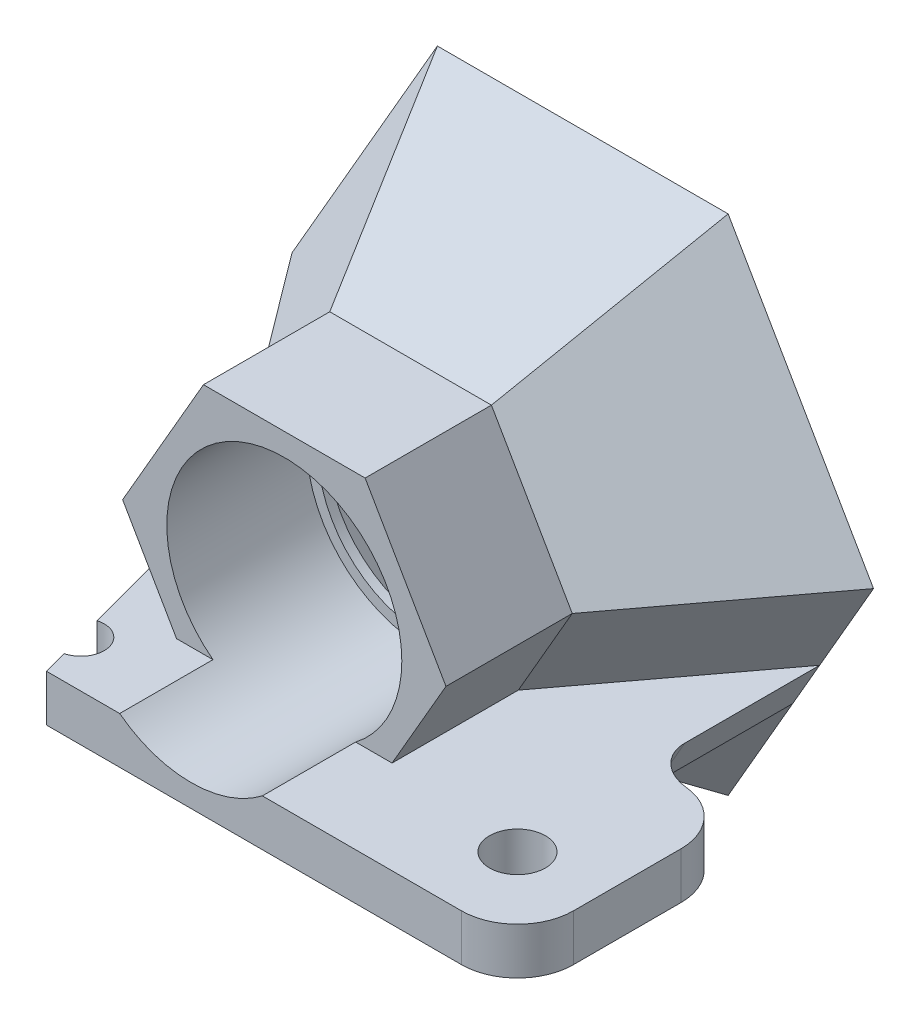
ISO-10303-21;
HEADER;
FILE_DESCRIPTION(('STEP AP214'),'2;1');
FILE_NAME('part.step','',(''),(''),'','','');
FILE_SCHEMA(('AUTOMOTIVE_DESIGN { 1 0 10303 214 1 1 1 1 }'));
ENDSEC;
DATA;
#1=APPLICATION_CONTEXT('core data for automotive mechanical design processes');
#2=APPLICATION_PROTOCOL_DEFINITION('international standard','automotive_design',2000,#1);
#3=PRODUCT_CONTEXT('',#1,'mechanical');
#4=PRODUCT('Part','Part','',(#3));
#5=PRODUCT_RELATED_PRODUCT_CATEGORY('part','',(#4));
#6=PRODUCT_DEFINITION_FORMATION('','',#4);
#7=PRODUCT_DEFINITION_CONTEXT('part definition',#1,'design');
#8=PRODUCT_DEFINITION('design','',#6,#7);
#9=PRODUCT_DEFINITION_SHAPE('','',#8);
#10=(LENGTH_UNIT() NAMED_UNIT(*) SI_UNIT(.MILLI.,.METRE.));
#11=(NAMED_UNIT(*) PLANE_ANGLE_UNIT() SI_UNIT($,.RADIAN.));
#12=(NAMED_UNIT(*) SI_UNIT($,.STERADIAN.) SOLID_ANGLE_UNIT());
#13=UNCERTAINTY_MEASURE_WITH_UNIT(LENGTH_MEASURE(1.E-05),#10,'distance_accuracy_value','');
#14=(GEOMETRIC_REPRESENTATION_CONTEXT(3) GLOBAL_UNCERTAINTY_ASSIGNED_CONTEXT((#13)) GLOBAL_UNIT_ASSIGNED_CONTEXT((#10,
#11,#12)) REPRESENTATION_CONTEXT('',''));
#15=CARTESIAN_POINT('',(0.,0.,0.));
#16=DIRECTION('',(0.,0.,1.));
#17=DIRECTION('',(1.,0.,0.));
#18=AXIS2_PLACEMENT_3D('',#15,#16,#17);
#19=CARTESIAN_POINT('',(-7.75,-15.0059240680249,21.));
#20=DIRECTION('',(0.965925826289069,0.,-0.258819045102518));
#21=DIRECTION('',(-0.258819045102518,0.,-0.965925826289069));
#22=AXIS2_PLACEMENT_3D('',#19,#20,#21);
#23=PLANE('',#22);
#24=DIRECTION('',(0.258819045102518,0.,0.965925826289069));
#25=VECTOR('',#24,1.);
#26=CARTESIAN_POINT('',(-125012.771141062,-7.50592406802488,-466504.090099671));
#27=LINE('',#26,#25);
#28=CARTESIAN_POINT('',(-11.0033478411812,-7.50592406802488,8.85834056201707));
#29=VERTEX_POINT('',#28);
#30=CARTESIAN_POINT('',(-8.74250507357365,-7.50592406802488,17.2959206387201));
#31=VERTEX_POINT('',#30);
#32=EDGE_CURVE('E304',#29,#31,#27,.T.);
#33=ORIENTED_EDGE('',*,*,#32,.T.);
#34=DIRECTION('',(0.,1.,0.));
#35=VECTOR('',#34,1.);
#36=CARTESIAN_POINT('',(-8.74250507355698,-15.0059240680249,17.2959206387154));
#37=LINE('',#36,#35);
#38=CARTESIAN_POINT('',(-8.74250507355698,-5.00592406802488,17.2959206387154));
#39=VERTEX_POINT('',#38);
#40=EDGE_CURVE('E280',#31,#39,#37,.T.);
#41=ORIENTED_EDGE('',*,*,#40,.T.);
#42=DIRECTION('',(-0.258819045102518,0.,-0.965925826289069));
#43=VECTOR('',#42,1.);
#44=CARTESIAN_POINT('',(-7.75,-5.00592406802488,21.));
#45=LINE('',#44,#43);
#46=CARTESIAN_POINT('',(-11.0033478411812,-5.00592406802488,8.85834056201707));
#47=VERTEX_POINT('',#46);
#48=EDGE_CURVE('E291',#39,#47,#45,.T.);
#49=ORIENTED_EDGE('',*,*,#48,.T.);
#50=DIRECTION('',(0.,1.,0.));
#51=VECTOR('',#50,1.);
#52=CARTESIAN_POINT('',(-11.0033478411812,-15.0059240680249,8.85834056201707));
#53=LINE('',#52,#51);
#54=EDGE_CURVE('E297',#29,#47,#53,.T.);
#55=ORIENTED_EDGE('',*,*,#54,.F.);
#56=EDGE_LOOP('',(#33,#41,#49,#55));
#57=FACE_BOUND('',#56,.T.);
#58=ADVANCED_FACE('F47',(#57),#23,.F.);
#59=CARTESIAN_POINT('',(11.2549099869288,-7.50592406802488,-500000.));
#60=DIRECTION('',(0.866025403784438,-0.500000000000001,0.));
#61=DIRECTION('',(0.500000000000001,0.866025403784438,0.));
#62=AXIS2_PLACEMENT_3D('',#59,#60,#61);
#63=PLANE('',#62);
#64=DIRECTION('',(0.,0.,1.));
#65=VECTOR('',#64,1.);
#66=CARTESIAN_POINT('',(12.6982856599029,-5.00592406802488,-500000.));
#67=LINE('',#66,#65);
#68=CARTESIAN_POINT('',(12.6982856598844,-5.00592406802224,1.70530256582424E-10));
#69=VERTEX_POINT('',#68);
#70=CARTESIAN_POINT('',(12.6982856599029,-5.00592406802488,7.23006751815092));
#71=VERTEX_POINT('',#70);
#72=EDGE_CURVE('E432',#69,#71,#67,.T.);
#73=ORIENTED_EDGE('',*,*,#72,.T.);
#74=DIRECTION('',(-0.500000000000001,-0.866025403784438,0.));
#75=VECTOR('',#74,1.);
#76=CARTESIAN_POINT('',(11.2549099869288,-7.50592406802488,7.23006751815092));
#77=LINE('',#76,#75);
#78=CARTESIAN_POINT('',(11.2549099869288,-7.50592406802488,7.23006751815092));
#79=VERTEX_POINT('',#78);
#80=EDGE_CURVE('E607',#71,#79,#77,.T.);
#81=ORIENTED_EDGE('',*,*,#80,.T.);
#82=DIRECTION('',(0.,0.,1.));
#83=VECTOR('',#82,1.);
#84=CARTESIAN_POINT('',(11.2549099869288,-7.50592406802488,-500000.));
#85=LINE('',#84,#83);
#86=CARTESIAN_POINT('',(11.2549099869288,-7.50592406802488,5.6843418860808E-11));
#87=VERTEX_POINT('',#86);
#88=EDGE_CURVE('E435',#87,#79,#85,.T.);
#89=ORIENTED_EDGE('',*,*,#88,.F.);
#90=DIRECTION('',(-0.500000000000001,-0.866025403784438,0.));
#91=VECTOR('',#90,1.);
#92=CARTESIAN_POINT('',(11.2549099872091,-7.50592406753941,5.6843418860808E-11));
#93=LINE('',#92,#91);
#94=EDGE_CURVE('E429',#87,#69,#93,.F.);
#95=ORIENTED_EDGE('',*,*,#94,.T.);
#96=EDGE_LOOP('',(#73,#81,#89,#95));
#97=FACE_BOUND('',#96,.T.);
#98=ADVANCED_FACE('F337',(#97),#63,.T.);
#99=CARTESIAN_POINT('',(-11.2549099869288,-7.50592406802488,-500000.));
#100=DIRECTION('',(-0.866025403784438,-0.500000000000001,0.));
#101=DIRECTION('',(0.500000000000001,-0.866025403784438,0.));
#102=AXIS2_PLACEMENT_3D('',#99,#100,#101);
#103=PLANE('',#102);
#104=DIRECTION('',(0.447213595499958,-0.774596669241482,0.44721359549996));
#105=VECTOR('',#104,1.);
#106=CARTESIAN_POINT('',(-100012.976265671,173200.556308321,-99993.1145772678));
#107=LINE('',#106,#105);
#108=CARTESIAN_POINT('',(-12.6982856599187,-5.00592406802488,7.16340274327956));
#109=VERTEX_POINT('',#108);
#110=CARTESIAN_POINT('',(-11.2549099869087,-7.50592406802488,8.60677841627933));
#111=VERTEX_POINT('',#110);
#112=EDGE_CURVE('E309',#109,#111,#107,.T.);
#113=ORIENTED_EDGE('',*,*,#112,.F.);
#114=DIRECTION('',(0.,0.,1.));
#115=VECTOR('',#114,1.);
#116=CARTESIAN_POINT('',(-12.6982856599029,-5.00592406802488,-500000.));
#117=LINE('',#116,#115);
#118=CARTESIAN_POINT('',(-12.6982856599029,-5.00592406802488,5.6843418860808E-11));
#119=VERTEX_POINT('',#118);
#120=EDGE_CURVE('E414',#119,#109,#117,.T.);
#121=ORIENTED_EDGE('',*,*,#120,.F.);
#122=DIRECTION('',(-0.500000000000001,0.866025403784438,0.));
#123=VECTOR('',#122,1.);
#124=CARTESIAN_POINT('',(-11.2549099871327,-7.50592406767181,5.6843418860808E-11));
#125=LINE('',#124,#123);
#126=CARTESIAN_POINT('',(-11.2549099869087,-7.50592406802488,5.6843418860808E-11));
#127=VERTEX_POINT('',#126);
#128=EDGE_CURVE('E413',#119,#127,#125,.F.);
#129=ORIENTED_EDGE('',*,*,#128,.T.);
#130=DIRECTION('',(0.,0.,1.));
#131=VECTOR('',#130,1.);
#132=CARTESIAN_POINT('',(-11.2549099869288,-7.50592406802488,-500000.));
#133=LINE('',#132,#131);
#134=EDGE_CURVE('E420',#127,#111,#133,.T.);
#135=ORIENTED_EDGE('',*,*,#134,.T.);
#136=EDGE_LOOP('',(#113,#121,#129,#135));
#137=FACE_BOUND('',#136,.T.);
#138=ADVANCED_FACE('F357',(#137),#103,.T.);
#139=CARTESIAN_POINT('',(-15.5884572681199,0.,0.));
#140=DIRECTION('',(-0.72631001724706,-0.419335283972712,0.544639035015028));
#141=DIRECTION('',(0.599934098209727,0.,0.800049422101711));
#142=AXIS2_PLACEMENT_3D('',#139,#140,#141);
#143=PLANE('',#142);
#144=DIRECTION('',(-0.299967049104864,-0.519558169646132,-0.800049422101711));
#145=VECTOR('',#144,1.);
#146=CARTESIAN_POINT('',(-7.79422863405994,-13.5,0.));
#147=LINE('',#146,#145);
#148=CARTESIAN_POINT('',(-4.33354728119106,-7.50592406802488,9.23006751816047));
#149=VERTEX_POINT('',#148);
#150=CARTESIAN_POINT('',(-7.79422863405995,-13.5,0.));
#151=VERTEX_POINT('',#150);
#152=EDGE_CURVE('E565',#149,#151,#147,.T.);
#153=ORIENTED_EDGE('',*,*,#152,.F.);
#154=DIRECTION('',(-0.599934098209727,0.,-0.800049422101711));
#155=VECTOR('',#154,1.);
#156=CARTESIAN_POINT('',(-239997.228052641,-7.50592406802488,-320036.216808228));
#157=LINE('',#156,#155);
#158=EDGE_CURVE('E411',#127,#149,#157,.F.);
#159=ORIENTED_EDGE('',*,*,#158,.F.);
#160=DIRECTION('',(0.5,-0.866025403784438,0.));
#161=VECTOR('',#160,1.);
#162=CARTESIAN_POINT('',(-15.5884572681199,0.,0.));
#163=LINE('',#162,#161);
#164=EDGE_CURVE('E545',#127,#151,#163,.T.);
#165=ORIENTED_EDGE('',*,*,#164,.T.);
#166=EDGE_LOOP('',(#153,#159,#165));
#167=FACE_BOUND('',#166,.T.);
#168=ADVANCED_FACE('F360',(#167),#143,.T.);
#169=CARTESIAN_POINT('',(7.79422863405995,-13.5,0.));
#170=DIRECTION('',(0.72631001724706,-0.419335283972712,0.544639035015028));
#171=DIRECTION('',(0.599934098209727,0.,-0.800049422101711));
#172=AXIS2_PLACEMENT_3D('',#169,#170,#171);
#173=PLANE('',#172);
#174=DIRECTION('',(-0.5,-0.866025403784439,0.));
#175=VECTOR('',#174,1.);
#176=CARTESIAN_POINT('',(4.33354728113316,-7.50592406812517,9.23006751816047));
#177=LINE('',#176,#175);
#178=CARTESIAN_POINT('',(5.77692295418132,-5.00592406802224,9.23006751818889));
#179=VERTEX_POINT('',#178);
#180=CARTESIAN_POINT('',(8.66709456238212,0.,9.23006751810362));
#181=VERTEX_POINT('',#180);
#182=EDGE_CURVE('E474',#179,#181,#177,.F.);
#183=ORIENTED_EDGE('',*,*,#182,.F.);
#184=DIRECTION('',(0.599934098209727,0.,-0.800049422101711));
#185=VECTOR('',#184,1.);
#186=CARTESIAN_POINT('',(240001.162571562,-5.0059240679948,-320039.538902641));
#187=LINE('',#186,#185);
#188=EDGE_CURVE('E438',#69,#179,#187,.F.);
#189=ORIENTED_EDGE('',*,*,#188,.F.);
#190=DIRECTION('',(0.5,0.866025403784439,0.));
#191=VECTOR('',#190,1.);
#192=CARTESIAN_POINT('',(7.79422863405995,-13.5,0.));
#193=LINE('',#192,#191);
#194=CARTESIAN_POINT('',(15.5884572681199,0.,0.));
#195=VERTEX_POINT('',#194);
#196=EDGE_CURVE('E552',#69,#195,#193,.T.);
#197=ORIENTED_EDGE('',*,*,#196,.T.);
#198=DIRECTION('',(0.599934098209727,0.,-0.800049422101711));
#199=VECTOR('',#198,1.);
#200=CARTESIAN_POINT('',(15.5884572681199,0.,0.));
#201=LINE('',#200,#199);
#202=EDGE_CURVE('E556',#181,#195,#201,.T.);
#203=ORIENTED_EDGE('',*,*,#202,.F.);
#204=EDGE_LOOP('',(#183,#189,#197,#203));
#205=FACE_BOUND('',#204,.T.);
#206=ADVANCED_FACE('F795',(#205),#173,.T.);
#207=CARTESIAN_POINT('',(15.5884572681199,0.,0.));
#208=DIRECTION('',(0.72631001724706,0.419335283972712,0.544639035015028));
#209=DIRECTION('',(0.599934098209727,0.,-0.800049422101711));
#210=AXIS2_PLACEMENT_3D('',#207,#208,#209);
#211=PLANE('',#210);
#212=DIRECTION('',(0.299967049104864,0.519558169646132,-0.800049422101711));
#213=VECTOR('',#212,1.);
#214=CARTESIAN_POINT('',(7.79422863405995,13.5,0.));
#215=LINE('',#214,#213);
#216=CARTESIAN_POINT('',(4.33354728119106,7.50592406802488,9.23006751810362));
#217=VERTEX_POINT('',#216);
#218=CARTESIAN_POINT('',(7.79422863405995,13.5,0.));
#219=VERTEX_POINT('',#218);
#220=EDGE_CURVE('E557',#217,#219,#215,.T.);
#221=ORIENTED_EDGE('',*,*,#220,.F.);
#222=DIRECTION('',(0.5,-0.866025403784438,0.));
#223=VECTOR('',#222,1.);
#224=CARTESIAN_POINT('',(8.66709456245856,-1.32398094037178E-10,9.23006751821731));
#225=LINE('',#224,#223);
#226=EDGE_CURVE('E477',#181,#217,#225,.F.);
#227=ORIENTED_EDGE('',*,*,#226,.F.);
#228=ORIENTED_EDGE('',*,*,#202,.T.);
#229=DIRECTION('',(-0.5,0.866025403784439,0.));
#230=VECTOR('',#229,1.);
#231=CARTESIAN_POINT('',(15.5884572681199,0.,0.));
#232=LINE('',#231,#230);
#233=EDGE_CURVE('E509',#195,#219,#232,.T.);
#234=ORIENTED_EDGE('',*,*,#233,.T.);
#235=EDGE_LOOP('',(#221,#227,#228,#234));
#236=FACE_BOUND('',#235,.T.);
#237=ADVANCED_FACE('F818',(#236),#211,.T.);
#238=CARTESIAN_POINT('',(7.79422863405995,13.5,0.));
#239=DIRECTION('',(0.,0.838670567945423,0.544639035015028));
#240=DIRECTION('',(0.,-0.544639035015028,0.838670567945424));
#241=AXIS2_PLACEMENT_3D('',#238,#239,#240);
#242=PLANE('',#241);
#243=DIRECTION('',(-0.299967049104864,0.519558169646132,-0.800049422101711));
#244=VECTOR('',#243,1.);
#245=CARTESIAN_POINT('',(-7.79422863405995,13.5,0.));
#246=LINE('',#245,#244);
#247=CARTESIAN_POINT('',(-4.33354728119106,7.50592406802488,9.23006751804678));
#248=VERTEX_POINT('',#247);
#249=CARTESIAN_POINT('',(-7.79422863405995,13.5,0.));
#250=VERTEX_POINT('',#249);
#251=EDGE_CURVE('E560',#248,#250,#246,.T.);
#252=ORIENTED_EDGE('',*,*,#251,.F.);
#253=DIRECTION('',(1.,0.,0.));
#254=VECTOR('',#253,1.);
#255=CARTESIAN_POINT('',(4.33354728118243,7.50592406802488,9.23006751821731));
#256=LINE('',#255,#254);
#257=EDGE_CURVE('E487',#217,#248,#256,.F.);
#258=ORIENTED_EDGE('',*,*,#257,.F.);
#259=ORIENTED_EDGE('',*,*,#220,.T.);
#260=DIRECTION('',(-1.,0.,0.));
#261=VECTOR('',#260,1.);
#262=CARTESIAN_POINT('',(7.79422863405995,13.5,0.));
#263=LINE('',#262,#261);
#264=EDGE_CURVE('E539',#219,#250,#263,.T.);
#265=ORIENTED_EDGE('',*,*,#264,.T.);
#266=EDGE_LOOP('',(#252,#258,#259,#265));
#267=FACE_BOUND('',#266,.T.);
#268=ADVANCED_FACE('F49',(#267),#242,.T.);
#269=CARTESIAN_POINT('',(-7.79422863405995,13.5,0.));
#270=DIRECTION('',(-0.72631001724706,0.419335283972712,0.544639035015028));
#271=DIRECTION('',(0.599934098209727,0.,0.800049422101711));
#272=AXIS2_PLACEMENT_3D('',#269,#270,#271);
#273=PLANE('',#272);
#274=DIRECTION('',(-0.599934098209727,0.,-0.800049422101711));
#275=VECTOR('',#274,1.);
#276=CARTESIAN_POINT('',(-15.5884572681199,0.,0.));
#277=LINE('',#276,#275);
#278=CARTESIAN_POINT('',(-8.66709456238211,0.,9.23006751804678));
#279=VERTEX_POINT('',#278);
#280=CARTESIAN_POINT('',(-15.5884572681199,0.,0.));
#281=VERTEX_POINT('',#280);
#282=EDGE_CURVE('E568',#279,#281,#277,.T.);
#283=ORIENTED_EDGE('',*,*,#282,.F.);
#284=DIRECTION('',(0.5,0.866025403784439,0.));
#285=VECTOR('',#284,1.);
#286=CARTESIAN_POINT('',(-4.33354728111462,7.50592406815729,9.23006751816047));
#287=LINE('',#286,#285);
#288=EDGE_CURVE('E485',#248,#279,#287,.F.);
#289=ORIENTED_EDGE('',*,*,#288,.F.);
#290=ORIENTED_EDGE('',*,*,#251,.T.);
#291=DIRECTION('',(-0.5,-0.866025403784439,0.));
#292=VECTOR('',#291,1.);
#293=CARTESIAN_POINT('',(-7.79422863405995,13.5,0.));
#294=LINE('',#293,#292);
#295=EDGE_CURVE('E542',#250,#281,#294,.T.);
#296=ORIENTED_EDGE('',*,*,#295,.T.);
#297=EDGE_LOOP('',(#283,#289,#290,#296));
#298=FACE_BOUND('',#297,.T.);
#299=ADVANCED_FACE('F809',(#298),#273,.T.);
#300=EDGE_CURVE('E546',#281,#119,#163,.T.);
#301=ORIENTED_EDGE('',*,*,#300,.T.);
#302=DIRECTION('',(0.599934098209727,0.,0.800049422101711));
#303=VECTOR('',#302,1.);
#304=CARTESIAN_POINT('',(-240001.162571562,-5.0059240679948,-320039.538902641));
#305=LINE('',#304,#303);
#306=CARTESIAN_POINT('',(-5.77692295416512,-5.00592406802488,9.23006751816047));
#307=VERTEX_POINT('',#306);
#308=EDGE_CURVE('E415',#307,#119,#305,.F.);
#309=ORIENTED_EDGE('',*,*,#308,.F.);
#310=DIRECTION('',(-0.5,0.866025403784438,0.));
#311=VECTOR('',#310,1.);
#312=CARTESIAN_POINT('',(-8.66709456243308,8.82728235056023E-11,9.23006751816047));
#313=LINE('',#312,#311);
#314=EDGE_CURVE('E481',#279,#307,#313,.F.);
#315=ORIENTED_EDGE('',*,*,#314,.F.);
#316=ORIENTED_EDGE('',*,*,#282,.T.);
#317=EDGE_LOOP('',(#301,#309,#315,#316));
#318=FACE_BOUND('',#317,.T.);
#319=ADVANCED_FACE('F801',(#318),#143,.T.);
#320=CARTESIAN_POINT('',(-7.79422863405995,-13.5,0.));
#321=DIRECTION('',(0.,-0.838670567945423,0.544639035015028));
#322=DIRECTION('',(0.,-0.544639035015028,-0.838670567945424));
#323=AXIS2_PLACEMENT_3D('',#320,#321,#322);
#324=PLANE('',#323);
#325=DIRECTION('',(0.299967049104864,-0.519558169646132,-0.800049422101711));
#326=VECTOR('',#325,1.);
#327=CARTESIAN_POINT('',(7.79422863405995,-13.5,0.));
#328=LINE('',#327,#326);
#329=CARTESIAN_POINT('',(4.33354728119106,-7.50592406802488,9.23006751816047));
#330=VERTEX_POINT('',#329);
#331=CARTESIAN_POINT('',(7.79422863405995,-13.5,0.));
#332=VERTEX_POINT('',#331);
#333=EDGE_CURVE('E563',#330,#332,#328,.T.);
#334=ORIENTED_EDGE('',*,*,#333,.F.);
#335=DIRECTION('',(-1.,0.,0.));
#336=VECTOR('',#335,1.);
#337=CARTESIAN_POINT('',(-4.33354728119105,-7.50592406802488,9.23006751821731));
#338=LINE('',#337,#336);
#339=EDGE_CURVE('E478',#149,#330,#338,.F.);
#340=ORIENTED_EDGE('',*,*,#339,.F.);
#341=ORIENTED_EDGE('',*,*,#152,.T.);
#342=DIRECTION('',(1.,0.,0.));
#343=VECTOR('',#342,1.);
#344=CARTESIAN_POINT('',(-7.79422863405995,-13.5,0.));
#345=LINE('',#344,#343);
#346=EDGE_CURVE('E549',#151,#332,#345,.T.);
#347=ORIENTED_EDGE('',*,*,#346,.T.);
#348=EDGE_LOOP('',(#334,#340,#341,#347));
#349=FACE_BOUND('',#348,.T.);
#350=ADVANCED_FACE('F792',(#349),#324,.T.);
#351=EDGE_CURVE('E553',#332,#87,#193,.T.);
#352=ORIENTED_EDGE('',*,*,#351,.T.);
#353=DIRECTION('',(-0.599934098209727,0.,0.800049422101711));
#354=VECTOR('',#353,1.);
#355=CARTESIAN_POINT('',(239997.228052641,-7.50592406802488,-320036.216808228));
#356=LINE('',#355,#354);
#357=EDGE_CURVE('E426',#330,#87,#356,.F.);
#358=ORIENTED_EDGE('',*,*,#357,.F.);
#359=ORIENTED_EDGE('',*,*,#333,.T.);
#360=EDGE_LOOP('',(#352,#358,#359));
#361=FACE_BOUND('',#360,.T.);
#362=ADVANCED_FACE('F783',(#361),#173,.T.);
#363=CARTESIAN_POINT('',(0.,27.,0.));
#364=DIRECTION('',(0.,0.,1.));
#365=DIRECTION('',(1.,0.,0.));
#366=AXIS2_PLACEMENT_3D('',#363,#364,#365);
#367=PLANE('',#366);
#368=DIRECTION('',(-1.,0.,0.));
#369=VECTOR('',#368,1.);
#370=CARTESIAN_POINT('',(6.41740609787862,-12.4726626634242,0.));
#371=LINE('',#370,#369);
#372=CARTESIAN_POINT('',(-7.20109514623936,-12.4726626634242,0.));
#373=VERTEX_POINT('',#372);
#374=CARTESIAN_POINT('',(7.20109514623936,-12.4726626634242,0.));
#375=VERTEX_POINT('',#374);
#376=EDGE_CURVE('E578',#373,#375,#371,.F.);
#377=ORIENTED_EDGE('',*,*,#376,.T.);
#378=DIRECTION('',(-0.5,-0.866025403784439,0.));
#379=VECTOR('',#378,1.);
#380=CARTESIAN_POINT('',(14.0103457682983,-0.678694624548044,0.));
#381=LINE('',#380,#379);
#382=CARTESIAN_POINT('',(14.4021902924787,0.,0.));
#383=VERTEX_POINT('',#382);
#384=EDGE_CURVE('E580',#375,#383,#381,.F.);
#385=ORIENTED_EDGE('',*,*,#384,.T.);
#386=DIRECTION('',(0.5,-0.866025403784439,0.));
#387=VECTOR('',#386,1.);
#388=CARTESIAN_POINT('',(7.59293967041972,11.7939680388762,0.));
#389=LINE('',#388,#387);
#390=CARTESIAN_POINT('',(7.20109514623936,12.4726626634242,0.));
#391=VERTEX_POINT('',#390);
#392=EDGE_CURVE('E559',#383,#391,#389,.F.);
#393=ORIENTED_EDGE('',*,*,#392,.T.);
#394=DIRECTION('',(1.,0.,0.));
#395=VECTOR('',#394,1.);
#396=CARTESIAN_POINT('',(-6.41740609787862,12.4726626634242,0.));
#397=LINE('',#396,#395);
#398=CARTESIAN_POINT('',(-7.20109514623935,12.4726626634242,0.));
#399=VERTEX_POINT('',#398);
#400=EDGE_CURVE('E572',#391,#399,#397,.F.);
#401=ORIENTED_EDGE('',*,*,#400,.T.);
#402=DIRECTION('',(0.5,0.866025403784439,0.));
#403=VECTOR('',#402,1.);
#404=CARTESIAN_POINT('',(-14.0103457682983,0.678694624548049,0.));
#405=LINE('',#404,#403);
#406=CARTESIAN_POINT('',(-14.4021902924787,0.,0.));
#407=VERTEX_POINT('',#406);
#408=EDGE_CURVE('E574',#399,#407,#405,.F.);
#409=ORIENTED_EDGE('',*,*,#408,.T.);
#410=DIRECTION('',(-0.5,0.866025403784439,0.));
#411=VECTOR('',#410,1.);
#412=CARTESIAN_POINT('',(-7.59293967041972,-11.7939680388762,0.));
#413=LINE('',#412,#411);
#414=EDGE_CURVE('E576',#407,#373,#413,.F.);
#415=ORIENTED_EDGE('',*,*,#414,.T.);
#416=EDGE_LOOP('',(#377,#385,#393,#401,#409,#415));
#417=FACE_BOUND('',#416,.T.);
#418=ORIENTED_EDGE('',*,*,#233,.F.);
#419=ORIENTED_EDGE('',*,*,#196,.F.);
#420=ORIENTED_EDGE('',*,*,#94,.F.);
#421=ORIENTED_EDGE('',*,*,#351,.F.);
#422=ORIENTED_EDGE('',*,*,#346,.F.);
#423=ORIENTED_EDGE('',*,*,#164,.F.);
#424=ORIENTED_EDGE('',*,*,#128,.F.);
#425=ORIENTED_EDGE('',*,*,#300,.F.);
#426=ORIENTED_EDGE('',*,*,#295,.F.);
#427=ORIENTED_EDGE('',*,*,#264,.F.);
#428=EDGE_LOOP('',(#418,#419,#420,#421,#422,#423,#424,#425,#426,#427));
#429=FACE_BOUND('',#428,.T.);
#430=ADVANCED_FACE('F778',(#417,#429),#367,.F.);
#431=CARTESIAN_POINT('',(14.1358372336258,-0.838670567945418,-1.08927807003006));
#432=DIRECTION('',(0.72631001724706,0.419335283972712,0.544639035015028));
#433=DIRECTION('',(0.599934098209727,0.,-0.800049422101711));
#434=AXIS2_PLACEMENT_3D('',#431,#432,#433);
#435=PLANE('',#434);
#436=DIRECTION('',(0.299967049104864,0.519558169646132,-0.800049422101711));
#437=VECTOR('',#436,1.);
#438=CARTESIAN_POINT('',(6.91295333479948,11.9735864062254,-1.32168610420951));
#439=LINE('',#438,#437);
#440=CARTESIAN_POINT('',(3.41792090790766,5.92001266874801,8.));
#441=VERTEX_POINT('',#440);
#442=CARTESIAN_POINT('',(5.99057845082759,10.3759862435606,1.13840241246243));
#443=VERTEX_POINT('',#442);
#444=EDGE_CURVE('E506',#441,#443,#439,.T.);
#445=ORIENTED_EDGE('',*,*,#444,.T.);
#446=DIRECTION('',(-0.5,0.866025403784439,0.));
#447=VECTOR('',#446,1.);
#448=CARTESIAN_POINT('',(12.1945707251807,-0.369643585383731,1.13840241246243));
#449=LINE('',#448,#447);
#450=CARTESIAN_POINT('',(11.9811569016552,0.,1.13840241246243));
#451=VERTEX_POINT('',#450);
#452=EDGE_CURVE('E594',#443,#451,#449,.F.);
#453=ORIENTED_EDGE('',*,*,#452,.T.);
#454=DIRECTION('',(0.599934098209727,0.,-0.800049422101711));
#455=VECTOR('',#454,1.);
#456=CARTESIAN_POINT('',(13.825906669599,0.,-1.32168610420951));
#457=LINE('',#456,#455);
#458=CARTESIAN_POINT('',(6.83584181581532,0.,8.));
#459=VERTEX_POINT('',#458);
#460=EDGE_CURVE('E514',#459,#451,#457,.T.);
#461=ORIENTED_EDGE('',*,*,#460,.F.);
#462=DIRECTION('',(0.5,-0.866025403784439,0.));
#463=VECTOR('',#462,1.);
#464=CARTESIAN_POINT('',(9.02399567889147,-3.78999366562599,8.));
#465=LINE('',#464,#463);
#466=EDGE_CURVE('E505',#459,#441,#465,.F.);
#467=ORIENTED_EDGE('',*,*,#466,.T.);
#468=EDGE_LOOP('',(#445,#453,#461,#467));
#469=FACE_BOUND('',#468,.T.);
#470=ADVANCED_FACE('F782',(#469),#435,.F.);
#471=CARTESIAN_POINT('',(7.79422863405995,11.8226588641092,-1.08927807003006));
#472=DIRECTION('',(0.,0.838670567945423,0.544639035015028));
#473=DIRECTION('',(0.,-0.544639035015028,0.838670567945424));
#474=AXIS2_PLACEMENT_3D('',#471,#472,#473);
#475=PLANE('',#474);
#476=DIRECTION('',(-0.299967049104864,0.519558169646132,-0.800049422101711));
#477=VECTOR('',#476,1.);
#478=CARTESIAN_POINT('',(-6.91295333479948,11.9735864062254,-1.32168610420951));
#479=LINE('',#478,#477);
#480=CARTESIAN_POINT('',(-3.41792090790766,5.92001266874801,8.));
#481=VERTEX_POINT('',#480);
#482=CARTESIAN_POINT('',(-5.99057845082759,10.3759862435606,1.13840241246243));
#483=VERTEX_POINT('',#482);
#484=EDGE_CURVE('E510',#481,#483,#479,.T.);
#485=ORIENTED_EDGE('',*,*,#484,.T.);
#486=DIRECTION('',(-1.,0.,0.));
#487=VECTOR('',#486,1.);
#488=CARTESIAN_POINT('',(6.41740609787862,10.3759862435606,1.13840241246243));
#489=LINE('',#488,#487);
#490=EDGE_CURVE('E592',#483,#443,#489,.F.);
#491=ORIENTED_EDGE('',*,*,#490,.T.);
#492=ORIENTED_EDGE('',*,*,#444,.F.);
#493=DIRECTION('',(1.,0.,0.));
#494=VECTOR('',#493,1.);
#495=CARTESIAN_POINT('',(7.79422863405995,5.92001266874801,8.));
#496=LINE('',#495,#494);
#497=EDGE_CURVE('E513',#441,#481,#496,.F.);
#498=ORIENTED_EDGE('',*,*,#497,.T.);
#499=EDGE_LOOP('',(#485,#491,#492,#498));
#500=FACE_BOUND('',#499,.T.);
#501=ADVANCED_FACE('F903',(#500),#475,.F.);
#502=CARTESIAN_POINT('',(-6.34160859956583,12.6613294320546,-1.08927807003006));
#503=DIRECTION('',(-0.72631001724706,0.419335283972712,0.544639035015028));
#504=DIRECTION('',(0.599934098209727,0.,0.800049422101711));
#505=AXIS2_PLACEMENT_3D('',#502,#503,#504);
#506=PLANE('',#505);
#507=DIRECTION('',(-0.599934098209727,0.,-0.800049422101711));
#508=VECTOR('',#507,1.);
#509=CARTESIAN_POINT('',(-13.825906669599,0.,-1.32168610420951));
#510=LINE('',#509,#508);
#511=CARTESIAN_POINT('',(-6.83584181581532,0.,8.));
#512=VERTEX_POINT('',#511);
#513=CARTESIAN_POINT('',(-11.9811569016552,0.,1.13840241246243));
#514=VERTEX_POINT('',#513);
#515=EDGE_CURVE('E521',#512,#514,#510,.T.);
#516=ORIENTED_EDGE('',*,*,#515,.T.);
#517=DIRECTION('',(-0.5,-0.866025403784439,0.));
#518=VECTOR('',#517,1.);
#519=CARTESIAN_POINT('',(-5.77716462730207,10.7456298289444,1.13840241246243));
#520=LINE('',#519,#518);
#521=EDGE_CURVE('E590',#514,#483,#520,.F.);
#522=ORIENTED_EDGE('',*,*,#521,.T.);
#523=ORIENTED_EDGE('',*,*,#484,.F.);
#524=DIRECTION('',(0.5,0.866025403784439,0.));
#525=VECTOR('',#524,1.);
#526=CARTESIAN_POINT('',(-1.22976704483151,9.71000633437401,8.));
#527=LINE('',#526,#525);
#528=EDGE_CURVE('E523',#481,#512,#527,.F.);
#529=ORIENTED_EDGE('',*,*,#528,.T.);
#530=EDGE_LOOP('',(#516,#522,#523,#529));
#531=FACE_BOUND('',#530,.T.);
#532=ADVANCED_FACE('F895',(#531),#506,.F.);
#533=CARTESIAN_POINT('',(-14.1358372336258,0.838670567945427,-1.08927807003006));
#534=DIRECTION('',(-0.72631001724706,-0.419335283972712,0.544639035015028));
#535=DIRECTION('',(0.599934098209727,0.,0.800049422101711));
#536=AXIS2_PLACEMENT_3D('',#533,#534,#535);
#537=PLANE('',#536);
#538=DIRECTION('',(-0.299967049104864,-0.519558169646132,-0.800049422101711));
#539=VECTOR('',#538,1.);
#540=CARTESIAN_POINT('',(-6.91295333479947,-11.9735864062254,-1.32168610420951));
#541=LINE('',#540,#539);
#542=CARTESIAN_POINT('',(-3.41792090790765,-5.92001266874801,8.));
#543=VERTEX_POINT('',#542);
#544=CARTESIAN_POINT('',(-5.99057845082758,-10.3759862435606,1.13840241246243));
#545=VERTEX_POINT('',#544);
#546=EDGE_CURVE('E526',#543,#545,#541,.T.);
#547=ORIENTED_EDGE('',*,*,#546,.T.);
#548=DIRECTION('',(0.5,-0.866025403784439,0.));
#549=VECTOR('',#548,1.);
#550=CARTESIAN_POINT('',(-12.1945707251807,0.369643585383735,1.13840241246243));
#551=LINE('',#550,#549);
#552=EDGE_CURVE('E588',#545,#514,#551,.F.);
#553=ORIENTED_EDGE('',*,*,#552,.T.);
#554=ORIENTED_EDGE('',*,*,#515,.F.);
#555=DIRECTION('',(-0.5,0.866025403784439,0.));
#556=VECTOR('',#555,1.);
#557=CARTESIAN_POINT('',(-9.02399567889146,3.789993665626,8.));
#558=LINE('',#557,#556);
#559=EDGE_CURVE('E528',#512,#543,#558,.F.);
#560=ORIENTED_EDGE('',*,*,#559,.T.);
#561=EDGE_LOOP('',(#547,#553,#554,#560));
#562=FACE_BOUND('',#561,.T.);
#563=ADVANCED_FACE('F887',(#562),#537,.F.);
#564=CARTESIAN_POINT('',(-7.79422863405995,-11.8226588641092,-1.08927807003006));
#565=DIRECTION('',(0.,-0.838670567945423,0.544639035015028));
#566=DIRECTION('',(0.,-0.544639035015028,-0.838670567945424));
#567=AXIS2_PLACEMENT_3D('',#564,#565,#566);
#568=PLANE('',#567);
#569=DIRECTION('',(0.299967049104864,-0.519558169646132,-0.800049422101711));
#570=VECTOR('',#569,1.);
#571=CARTESIAN_POINT('',(6.91295333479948,-11.9735864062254,-1.32168610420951));
#572=LINE('',#571,#570);
#573=CARTESIAN_POINT('',(3.41792090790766,-5.92001266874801,8.));
#574=VERTEX_POINT('',#573);
#575=CARTESIAN_POINT('',(5.99057845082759,-10.3759862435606,1.13840241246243));
#576=VERTEX_POINT('',#575);
#577=EDGE_CURVE('E517',#574,#576,#572,.T.);
#578=ORIENTED_EDGE('',*,*,#577,.T.);
#579=DIRECTION('',(1.,0.,0.));
#580=VECTOR('',#579,1.);
#581=CARTESIAN_POINT('',(-6.41740609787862,-10.3759862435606,1.13840241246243));
#582=LINE('',#581,#580);
#583=EDGE_CURVE('E586',#576,#545,#582,.F.);
#584=ORIENTED_EDGE('',*,*,#583,.T.);
#585=ORIENTED_EDGE('',*,*,#546,.F.);
#586=DIRECTION('',(-1.,0.,0.));
#587=VECTOR('',#586,1.);
#588=CARTESIAN_POINT('',(-7.79422863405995,-5.92001266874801,8.));
#589=LINE('',#588,#587);
#590=EDGE_CURVE('E532',#543,#574,#589,.F.);
#591=ORIENTED_EDGE('',*,*,#590,.T.);
#592=EDGE_LOOP('',(#578,#584,#585,#591));
#593=FACE_BOUND('',#592,.T.);
#594=ADVANCED_FACE('F878',(#593),#568,.F.);
#595=CARTESIAN_POINT('',(6.34160859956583,-12.6613294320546,-1.08927807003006));
#596=DIRECTION('',(0.72631001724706,-0.419335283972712,0.544639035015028));
#597=DIRECTION('',(0.599934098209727,0.,-0.800049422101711));
#598=AXIS2_PLACEMENT_3D('',#595,#596,#597);
#599=PLANE('',#598);
#600=ORIENTED_EDGE('',*,*,#460,.T.);
#601=DIRECTION('',(0.5,0.866025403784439,0.));
#602=VECTOR('',#601,1.);
#603=CARTESIAN_POINT('',(5.77716462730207,-10.7456298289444,1.13840241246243));
#604=LINE('',#603,#602);
#605=EDGE_CURVE('E583',#451,#576,#604,.F.);
#606=ORIENTED_EDGE('',*,*,#605,.T.);
#607=ORIENTED_EDGE('',*,*,#577,.F.);
#608=DIRECTION('',(-0.5,-0.866025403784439,0.));
#609=VECTOR('',#608,1.);
#610=CARTESIAN_POINT('',(1.22976704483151,-9.710006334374,8.));
#611=LINE('',#610,#609);
#612=EDGE_CURVE('E518',#574,#459,#611,.F.);
#613=ORIENTED_EDGE('',*,*,#612,.T.);
#614=EDGE_LOOP('',(#600,#606,#607,#613));
#615=FACE_BOUND('',#614,.T.);
#616=ADVANCED_FACE('F874',(#615),#599,.F.);
#617=CARTESIAN_POINT('',(0.,27.,8.));
#618=DIRECTION('',(0.,0.,1.));
#619=DIRECTION('',(1.,0.,0.));
#620=AXIS2_PLACEMENT_3D('',#617,#618,#619);
#621=PLANE('',#620);
#622=CARTESIAN_POINT('',(0.,0.,8.));
#623=DIRECTION('',(0.,0.,1.));
#624=DIRECTION('',(1.,0.,0.));
#625=AXIS2_PLACEMENT_3D('',#622,#623,#624);
#626=CIRCLE('',#625,5.7);
#627=CARTESIAN_POINT('',(5.7,0.,8.));
#628=VERTEX_POINT('',#627);
#629=EDGE_CURVE('E499',#628,#628,#626,.T.);
#630=ORIENTED_EDGE('',*,*,#629,.T.);
#631=EDGE_LOOP('',(#630));
#632=FACE_BOUND('',#631,.T.);
#633=ORIENTED_EDGE('',*,*,#466,.F.);
#634=ORIENTED_EDGE('',*,*,#612,.F.);
#635=ORIENTED_EDGE('',*,*,#590,.F.);
#636=ORIENTED_EDGE('',*,*,#559,.F.);
#637=ORIENTED_EDGE('',*,*,#528,.F.);
#638=ORIENTED_EDGE('',*,*,#497,.F.);
#639=EDGE_LOOP('',(#633,#634,#635,#636,#637,#638));
#640=FACE_BOUND('',#639,.T.);
#641=ADVANCED_FACE('F645',(#632,#640),#621,.F.);
#642=CARTESIAN_POINT('',(0.,0.,8.5));
#643=DIRECTION('',(0.,0.,1.));
#644=DIRECTION('',(1.,0.,0.));
#645=AXIS2_PLACEMENT_3D('',#642,#643,#644);
#646=CYLINDRICAL_SURFACE('',#645,6.3);
#647=DIRECTION('',(0.,0.,1.));
#648=VECTOR('',#647,1.);
#649=CARTESIAN_POINT('',(3.82501297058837,-5.00592406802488,9.23006751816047));
#650=LINE('',#649,#648);
#651=CARTESIAN_POINT('',(3.82501297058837,-5.00592406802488,16.));
#652=VERTEX_POINT('',#651);
#653=CARTESIAN_POINT('',(3.82501297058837,-5.00592406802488,21.));
#654=VERTEX_POINT('',#653);
#655=EDGE_CURVE('E390',#652,#654,#650,.T.);
#656=ORIENTED_EDGE('',*,*,#655,.F.);
#657=CARTESIAN_POINT('',(0.,0.,16.));
#658=DIRECTION('',(0.,0.,1.));
#659=DIRECTION('',(1.,0.,0.));
#660=AXIS2_PLACEMENT_3D('',#657,#658,#659);
#661=CIRCLE('',#660,6.3);
#662=CARTESIAN_POINT('',(-3.82501297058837,-5.00592406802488,16.));
#663=VERTEX_POINT('',#662);
#664=EDGE_CURVE('E456',#652,#663,#661,.T.);
#665=ORIENTED_EDGE('',*,*,#664,.T.);
#666=DIRECTION('',(0.,0.,1.));
#667=VECTOR('',#666,1.);
#668=CARTESIAN_POINT('',(-3.82501297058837,-5.00592406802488,9.23006751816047));
#669=LINE('',#668,#667);
#670=CARTESIAN_POINT('',(-3.82501297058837,-5.00592406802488,21.));
#671=VERTEX_POINT('',#670);
#672=EDGE_CURVE('E403',#663,#671,#669,.T.);
#673=ORIENTED_EDGE('',*,*,#672,.T.);
#674=CARTESIAN_POINT('',(0.,0.,21.));
#675=DIRECTION('',(0.,0.,-1.));
#676=DIRECTION('',(1.,0.,0.));
#677=AXIS2_PLACEMENT_3D('',#674,#675,#676);
#678=CIRCLE('',#677,6.30000000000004);
#679=EDGE_CURVE('E392',#654,#671,#678,.T.);
#680=ORIENTED_EDGE('',*,*,#679,.F.);
#681=EDGE_LOOP('',(#656,#665,#673,#680));
#682=FACE_BOUND('',#681,.T.);
#683=CARTESIAN_POINT('',(0.,0.,8.5));
#684=DIRECTION('',(0.,0.,1.));
#685=DIRECTION('',(1.,0.,0.));
#686=AXIS2_PLACEMENT_3D('',#683,#684,#685);
#687=CIRCLE('',#686,6.3);
#688=CARTESIAN_POINT('',(6.3,0.,8.5));
#689=VERTEX_POINT('',#688);
#690=EDGE_CURVE('E502',#689,#689,#687,.T.);
#691=ORIENTED_EDGE('',*,*,#690,.F.);
#692=EDGE_LOOP('',(#691));
#693=FACE_BOUND('',#692,.T.);
#694=ADVANCED_FACE('F641',(#682,#693),#646,.F.);
#695=CARTESIAN_POINT('',(0.,0.,8.5));
#696=DIRECTION('',(0.,0.,1.));
#697=DIRECTION('',(1.,0.,0.));
#698=AXIS2_PLACEMENT_3D('',#695,#696,#697);
#699=PLANE('',#698);
#700=CARTESIAN_POINT('',(0.,0.,8.5));
#701=DIRECTION('',(0.,0.,1.));
#702=DIRECTION('',(1.,0.,0.));
#703=AXIS2_PLACEMENT_3D('',#700,#701,#702);
#704=CIRCLE('',#703,5.7);
#705=CARTESIAN_POINT('',(5.7,0.,8.5));
#706=VERTEX_POINT('',#705);
#707=EDGE_CURVE('E476',#706,#706,#704,.T.);
#708=ORIENTED_EDGE('',*,*,#707,.F.);
#709=EDGE_LOOP('',(#708));
#710=FACE_BOUND('',#709,.T.);
#711=ORIENTED_EDGE('',*,*,#690,.T.);
#712=EDGE_LOOP('',(#711));
#713=FACE_BOUND('',#712,.T.);
#714=ADVANCED_FACE('F644',(#710,#713),#699,.T.);
#715=CARTESIAN_POINT('',(0.,0.,0.));
#716=DIRECTION('',(0.,0.,1.));
#717=DIRECTION('',(1.,0.,0.));
#718=AXIS2_PLACEMENT_3D('',#715,#716,#717);
#719=CYLINDRICAL_SURFACE('',#718,5.7);
#720=ORIENTED_EDGE('',*,*,#707,.T.);
#721=EDGE_LOOP('',(#720));
#722=FACE_BOUND('',#721,.T.);
#723=ORIENTED_EDGE('',*,*,#629,.F.);
#724=EDGE_LOOP('',(#723));
#725=FACE_BOUND('',#724,.T.);
#726=ADVANCED_FACE('F650',(#722,#725),#719,.F.);
#727=CARTESIAN_POINT('',(-4.33354728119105,-7.50592406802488,-500000.));
#728=DIRECTION('',(0.,-1.,0.));
#729=DIRECTION('',(0.,0.,-1.));
#730=AXIS2_PLACEMENT_3D('',#727,#728,#729);
#731=PLANE('',#730);
#732=DIRECTION('',(0.,0.,1.));
#733=VECTOR('',#732,1.);
#734=CARTESIAN_POINT('',(17.5,-7.50592406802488,9.23006751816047));
#735=LINE('',#734,#733);
#736=CARTESIAN_POINT('',(17.5,-7.50592406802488,12.2300675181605));
#737=VERTEX_POINT('',#736);
#738=CARTESIAN_POINT('',(17.5,-7.50592406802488,18.));
#739=VERTEX_POINT('',#738);
#740=EDGE_CURVE('E400',#737,#739,#735,.T.);
#741=ORIENTED_EDGE('',*,*,#740,.T.);
#742=CARTESIAN_POINT('',(14.5,-7.50592406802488,18.));
#743=DIRECTION('',(0.,-1.,0.));
#744=DIRECTION('',(0.,0.,-1.));
#745=AXIS2_PLACEMENT_3D('',#742,#743,#744);
#746=CIRCLE('',#745,3.);
#747=CARTESIAN_POINT('',(14.5,-7.50592406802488,21.));
#748=VERTEX_POINT('',#747);
#749=EDGE_CURVE('E12',#739,#748,#746,.T.);
#750=ORIENTED_EDGE('',*,*,#749,.T.);
#751=DIRECTION('',(1.,0.,0.));
#752=VECTOR('',#751,1.);
#753=CARTESIAN_POINT('',(-17.5,-7.50592406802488,21.));
#754=LINE('',#753,#752);
#755=CARTESIAN_POINT('',(-7.75,-7.50592406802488,21.));
#756=VERTEX_POINT('',#755);
#757=EDGE_CURVE('E386',#756,#748,#754,.T.);
#758=ORIENTED_EDGE('',*,*,#757,.F.);
#759=CARTESIAN_POINT('',(-8.0954904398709,-7.50592406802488,19.7106121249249));
#760=VERTEX_POINT('',#759);
#761=EDGE_CURVE('E303',#760,#756,#27,.T.);
#762=ORIENTED_EDGE('',*,*,#761,.F.);
#763=CARTESIAN_POINT('',(-8.40680745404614,-7.50592406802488,18.5));
#764=DIRECTION('',(0.,-1.,0.));
#765=DIRECTION('',(0.,0.,-1.));
#766=AXIS2_PLACEMENT_3D('',#763,#764,#765);
#767=CIRCLE('',#766,1.2500000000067);
#768=EDGE_CURVE('E276',#31,#760,#767,.T.);
#769=ORIENTED_EDGE('',*,*,#768,.F.);
#770=ORIENTED_EDGE('',*,*,#32,.F.);
#771=DIRECTION('',(0.707106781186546,0.,0.707106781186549));
#772=VECTOR('',#771,1.);
#773=CARTESIAN_POINT('',(-250012.097617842,-7.50592406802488,-249992.23592944));
#774=LINE('',#773,#772);
#775=EDGE_CURVE('E307',#111,#29,#774,.T.);
#776=ORIENTED_EDGE('',*,*,#775,.F.);
#777=ORIENTED_EDGE('',*,*,#134,.F.);
#778=ORIENTED_EDGE('',*,*,#158,.T.);
#779=ORIENTED_EDGE('',*,*,#339,.T.);
#780=ORIENTED_EDGE('',*,*,#357,.T.);
#781=ORIENTED_EDGE('',*,*,#88,.T.);
#782=CARTESIAN_POINT('',(13.5643110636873,-7.50592406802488,7.23006751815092));
#783=DIRECTION('',(0.,-1.,0.));
#784=DIRECTION('',(-1.,0.,0.));
#785=AXIS2_PLACEMENT_3D('',#782,#783,#784);
#786=ELLIPSE('',#785,2.3094010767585,2.);
#787=CARTESIAN_POINT('',(13.5643110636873,-7.50592406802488,9.23006751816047));
#788=VERTEX_POINT('',#787);
#789=EDGE_CURVE('E613',#79,#788,#786,.F.);
#790=ORIENTED_EDGE('',*,*,#789,.T.);
#791=DIRECTION('',(1.,0.,0.));
#792=VECTOR('',#791,1.);
#793=CARTESIAN_POINT('',(-17.5,-7.50592406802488,9.23006751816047));
#794=LINE('',#793,#792);
#795=CARTESIAN_POINT('',(14.5,-7.50592406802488,9.23006751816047));
#796=VERTEX_POINT('',#795);
#797=EDGE_CURVE('E397',#788,#796,#794,.T.);
#798=ORIENTED_EDGE('',*,*,#797,.T.);
#799=CARTESIAN_POINT('',(14.5,-7.50592406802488,12.2300675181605));
#800=DIRECTION('',(0.,-1.,0.));
#801=DIRECTION('',(0.,0.,-1.));
#802=AXIS2_PLACEMENT_3D('',#799,#800,#801);
#803=CIRCLE('',#802,3.);
#804=EDGE_CURVE('E605',#796,#737,#803,.T.);
#805=ORIENTED_EDGE('',*,*,#804,.T.);
#806=EDGE_LOOP('',(#741,#750,#758,#762,#769,#770,#776,#777,#778,#779,#780,#781,#790,#798,#805));
#807=FACE_BOUND('',#806,.T.);
#808=CARTESIAN_POINT('',(13.2604040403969,-7.50592406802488,16.7604040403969));
#809=DIRECTION('',(0.,-1.,0.));
#810=DIRECTION('',(0.,0.,-1.));
#811=AXIS2_PLACEMENT_3D('',#808,#809,#810);
#812=CIRCLE('',#811,1.5);
#813=CARTESIAN_POINT('',(13.2604040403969,-7.50592406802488,15.2604040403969));
#814=VERTEX_POINT('',#813);
#815=EDGE_CURVE('E314',#814,#814,#812,.T.);
#816=ORIENTED_EDGE('',*,*,#815,.F.);
#817=EDGE_LOOP('',(#816));
#818=FACE_BOUND('',#817,.T.);
#819=ADVANCED_FACE('F631',(#807,#818),#731,.T.);
#820=CARTESIAN_POINT('',(-8.66709456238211,0.,-500000.));
#821=DIRECTION('',(-0.866025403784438,-0.5,0.));
#822=DIRECTION('',(0.5,-0.866025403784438,0.));
#823=AXIS2_PLACEMENT_3D('',#820,#821,#822);
#824=PLANE('',#823);
#825=DIRECTION('',(0.,0.,1.));
#826=VECTOR('',#825,1.);
#827=CARTESIAN_POINT('',(-5.77692295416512,-5.00592406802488,-500000.));
#828=LINE('',#827,#826);
#829=CARTESIAN_POINT('',(-5.77692295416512,-5.00592406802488,16.));
#830=VERTEX_POINT('',#829);
#831=EDGE_CURVE('E410',#307,#830,#828,.T.);
#832=ORIENTED_EDGE('',*,*,#831,.T.);
#833=DIRECTION('',(0.5,-0.866025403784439,0.));
#834=VECTOR('',#833,1.);
#835=CARTESIAN_POINT('',(-8.66709456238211,0.,16.));
#836=LINE('',#835,#834);
#837=CARTESIAN_POINT('',(-8.66709456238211,0.,16.));
#838=VERTEX_POINT('',#837);
#839=EDGE_CURVE('E470',#838,#830,#836,.T.);
#840=ORIENTED_EDGE('',*,*,#839,.F.);
#841=DIRECTION('',(0.,0.,1.));
#842=VECTOR('',#841,1.);
#843=CARTESIAN_POINT('',(-8.66709456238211,0.,-500000.));
#844=LINE('',#843,#842);
#845=EDGE_CURVE('E473',#279,#838,#844,.T.);
#846=ORIENTED_EDGE('',*,*,#845,.F.);
#847=ORIENTED_EDGE('',*,*,#314,.T.);
#848=EDGE_LOOP('',(#832,#840,#846,#847));
#849=FACE_BOUND('',#848,.T.);
#850=ADVANCED_FACE('F706',(#849),#824,.T.);
#851=CARTESIAN_POINT('',(-4.33354728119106,7.50592406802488,-500000.));
#852=DIRECTION('',(-0.866025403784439,0.5,0.));
#853=DIRECTION('',(-0.5,-0.866025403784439,0.));
#854=AXIS2_PLACEMENT_3D('',#851,#852,#853);
#855=PLANE('',#854);
#856=DIRECTION('',(0.,0.,1.));
#857=VECTOR('',#856,1.);
#858=CARTESIAN_POINT('',(-4.33354728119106,7.50592406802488,-500000.));
#859=LINE('',#858,#857);
#860=CARTESIAN_POINT('',(-4.33354728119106,7.50592406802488,16.));
#861=VERTEX_POINT('',#860);
#862=EDGE_CURVE('E491',#248,#861,#859,.T.);
#863=ORIENTED_EDGE('',*,*,#862,.F.);
#864=ORIENTED_EDGE('',*,*,#288,.T.);
#865=ORIENTED_EDGE('',*,*,#845,.T.);
#866=DIRECTION('',(-0.5,-0.866025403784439,0.));
#867=VECTOR('',#866,1.);
#868=CARTESIAN_POINT('',(-4.33354728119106,7.50592406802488,16.));
#869=LINE('',#868,#867);
#870=EDGE_CURVE('E467',#861,#838,#869,.T.);
#871=ORIENTED_EDGE('',*,*,#870,.F.);
#872=EDGE_LOOP('',(#863,#864,#865,#871));
#873=FACE_BOUND('',#872,.T.);
#874=ADVANCED_FACE('F766',(#873),#855,.T.);
#875=CARTESIAN_POINT('',(4.33354728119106,7.50592406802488,-500000.));
#876=DIRECTION('',(0.,1.,0.));
#877=DIRECTION('',(-1.,0.,0.));
#878=AXIS2_PLACEMENT_3D('',#875,#876,#877);
#879=PLANE('',#878);
#880=DIRECTION('',(0.,0.,1.));
#881=VECTOR('',#880,1.);
#882=CARTESIAN_POINT('',(4.33354728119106,7.50592406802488,-500000.));
#883=LINE('',#882,#881);
#884=CARTESIAN_POINT('',(4.33354728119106,7.50592406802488,16.));
#885=VERTEX_POINT('',#884);
#886=EDGE_CURVE('E493',#217,#885,#883,.T.);
#887=ORIENTED_EDGE('',*,*,#886,.F.);
#888=ORIENTED_EDGE('',*,*,#257,.T.);
#889=ORIENTED_EDGE('',*,*,#862,.T.);
#890=DIRECTION('',(-1.,0.,0.));
#891=VECTOR('',#890,1.);
#892=CARTESIAN_POINT('',(4.33354728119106,7.50592406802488,16.));
#893=LINE('',#892,#891);
#894=EDGE_CURVE('E464',#885,#861,#893,.T.);
#895=ORIENTED_EDGE('',*,*,#894,.F.);
#896=EDGE_LOOP('',(#887,#888,#889,#895));
#897=FACE_BOUND('',#896,.T.);
#898=ADVANCED_FACE('F923',(#897),#879,.T.);
#899=CARTESIAN_POINT('',(8.66709456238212,0.,-500000.));
#900=DIRECTION('',(0.866025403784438,0.5,0.));
#901=DIRECTION('',(-0.5,0.866025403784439,0.));
#902=AXIS2_PLACEMENT_3D('',#899,#900,#901);
#903=PLANE('',#902);
#904=DIRECTION('',(0.,0.,1.));
#905=VECTOR('',#904,1.);
#906=CARTESIAN_POINT('',(8.66709456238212,0.,-500000.));
#907=LINE('',#906,#905);
#908=CARTESIAN_POINT('',(8.66709456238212,0.,16.));
#909=VERTEX_POINT('',#908);
#910=EDGE_CURVE('E482',#181,#909,#907,.T.);
#911=ORIENTED_EDGE('',*,*,#910,.F.);
#912=ORIENTED_EDGE('',*,*,#226,.T.);
#913=ORIENTED_EDGE('',*,*,#886,.T.);
#914=DIRECTION('',(-0.5,0.866025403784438,0.));
#915=VECTOR('',#914,1.);
#916=CARTESIAN_POINT('',(8.66709456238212,0.,16.));
#917=LINE('',#916,#915);
#918=EDGE_CURVE('E461',#909,#885,#917,.T.);
#919=ORIENTED_EDGE('',*,*,#918,.F.);
#920=EDGE_LOOP('',(#911,#912,#913,#919));
#921=FACE_BOUND('',#920,.T.);
#922=ADVANCED_FACE('F758',(#921),#903,.T.);
#923=CARTESIAN_POINT('',(4.33354728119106,-7.50592406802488,-500000.));
#924=DIRECTION('',(0.866025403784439,-0.5,0.));
#925=DIRECTION('',(0.5,0.866025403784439,0.));
#926=AXIS2_PLACEMENT_3D('',#923,#924,#925);
#927=PLANE('',#926);
#928=DIRECTION('',(0.,0.,1.));
#929=VECTOR('',#928,1.);
#930=CARTESIAN_POINT('',(5.77692295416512,-5.00592406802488,-500000.));
#931=LINE('',#930,#929);
#932=CARTESIAN_POINT('',(5.77692295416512,-5.00592406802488,16.));
#933=VERTEX_POINT('',#932);
#934=EDGE_CURVE('E417',#179,#933,#931,.T.);
#935=ORIENTED_EDGE('',*,*,#934,.F.);
#936=ORIENTED_EDGE('',*,*,#182,.T.);
#937=ORIENTED_EDGE('',*,*,#910,.T.);
#938=DIRECTION('',(0.5,0.866025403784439,0.));
#939=VECTOR('',#938,1.);
#940=CARTESIAN_POINT('',(4.33354728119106,-7.50592406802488,16.));
#941=LINE('',#940,#939);
#942=EDGE_CURVE('E459',#933,#909,#941,.T.);
#943=ORIENTED_EDGE('',*,*,#942,.F.);
#944=EDGE_LOOP('',(#935,#936,#937,#943));
#945=FACE_BOUND('',#944,.T.);
#946=ADVANCED_FACE('F659',(#945),#927,.T.);
#947=CARTESIAN_POINT('',(8.66709456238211,0.,16.));
#948=DIRECTION('',(0.,0.,1.));
#949=DIRECTION('',(1.,0.,0.));
#950=AXIS2_PLACEMENT_3D('',#947,#948,#949);
#951=PLANE('',#950);
#952=DIRECTION('',(-1.,0.,0.));
#953=VECTOR('',#952,1.);
#954=CARTESIAN_POINT('',(8.66709456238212,-5.00592406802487,16.));
#955=LINE('',#954,#953);
#956=EDGE_CURVE('E402',#663,#830,#955,.T.);
#957=ORIENTED_EDGE('',*,*,#956,.F.);
#958=ORIENTED_EDGE('',*,*,#664,.F.);
#959=DIRECTION('',(-1.,0.,0.));
#960=VECTOR('',#959,1.);
#961=CARTESIAN_POINT('',(8.66709456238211,-5.00592406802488,16.));
#962=LINE('',#961,#960);
#963=EDGE_CURVE('E408',#933,#652,#962,.T.);
#964=ORIENTED_EDGE('',*,*,#963,.F.);
#965=ORIENTED_EDGE('',*,*,#942,.T.);
#966=ORIENTED_EDGE('',*,*,#918,.T.);
#967=ORIENTED_EDGE('',*,*,#894,.T.);
#968=ORIENTED_EDGE('',*,*,#870,.T.);
#969=ORIENTED_EDGE('',*,*,#839,.T.);
#970=EDGE_LOOP('',(#957,#958,#964,#965,#966,#967,#968,#969));
#971=FACE_BOUND('',#970,.T.);
#972=ADVANCED_FACE('F639',(#971),#951,.T.);
#973=CARTESIAN_POINT('',(0.889700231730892,26.4863313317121,2.5));
#974=DIRECTION('',(-0.5,-0.866025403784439,0.));
#975=DIRECTION('',(0.866025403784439,-0.5,0.));
#976=AXIS2_PLACEMENT_3D('',#973,#974,#975);
#977=CYLINDRICAL_SURFACE('',#976,2.5);
#978=CARTESIAN_POINT('',(-7.20109514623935,12.4726626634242,2.5));
#979=DIRECTION('',(-0.866025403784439,-0.5,0.));
#980=DIRECTION('',(0.5,-0.866025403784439,0.));
#981=AXIS2_PLACEMENT_3D('',#978,#979,#980);
#982=ELLIPSE('',#981,2.88675134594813,2.5);
#983=EDGE_CURVE('E450',#483,#399,#982,.F.);
#984=ORIENTED_EDGE('',*,*,#983,.F.);
#985=ORIENTED_EDGE('',*,*,#521,.F.);
#986=CARTESIAN_POINT('',(-14.4021902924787,0.,2.5));
#987=DIRECTION('',(0.,-1.,0.));
#988=DIRECTION('',(1.,0.,0.));
#989=AXIS2_PLACEMENT_3D('',#986,#987,#988);
#990=ELLIPSE('',#989,2.88675134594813,2.5);
#991=EDGE_CURVE('E453',#407,#514,#990,.T.);
#992=ORIENTED_EDGE('',*,*,#991,.F.);
#993=ORIENTED_EDGE('',*,*,#408,.F.);
#994=EDGE_LOOP('',(#984,#985,#992,#993));
#995=FACE_BOUND('',#994,.T.);
#996=ADVANCED_FACE('F750',(#995),#977,.T.);
#997=CARTESIAN_POINT('',(-22.492985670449,14.0136686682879,2.5));
#998=DIRECTION('',(0.5,-0.866025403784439,0.));
#999=DIRECTION('',(0.866025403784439,0.5,0.));
#1000=AXIS2_PLACEMENT_3D('',#997,#998,#999);
#1001=CYLINDRICAL_SURFACE('',#1000,2.5);
#1002=ORIENTED_EDGE('',*,*,#991,.T.);
#1003=ORIENTED_EDGE('',*,*,#552,.F.);
#1004=CARTESIAN_POINT('',(-7.20109514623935,-12.4726626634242,2.5));
#1005=DIRECTION('',(0.866025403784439,-0.5,0.));
#1006=DIRECTION('',(0.5,0.866025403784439,0.));
#1007=AXIS2_PLACEMENT_3D('',#1004,#1005,#1006);
#1008=ELLIPSE('',#1007,2.88675134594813,2.5);
#1009=EDGE_CURVE('E447',#373,#545,#1008,.T.);
#1010=ORIENTED_EDGE('',*,*,#1009,.F.);
#1011=ORIENTED_EDGE('',*,*,#414,.F.);
#1012=EDGE_LOOP('',(#1002,#1003,#1010,#1011));
#1013=FACE_BOUND('',#1012,.T.);
#1014=ADVANCED_FACE('F855',(#1013),#1001,.T.);
#1015=CARTESIAN_POINT('',(0.,12.4726626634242,2.5));
#1016=DIRECTION('',(-1.,0.,0.));
#1017=DIRECTION('',(0.,-1.,0.));
#1018=AXIS2_PLACEMENT_3D('',#1015,#1016,#1017);
#1019=CYLINDRICAL_SURFACE('',#1018,2.5);
#1020=ORIENTED_EDGE('',*,*,#983,.T.);
#1021=ORIENTED_EDGE('',*,*,#400,.F.);
#1022=CARTESIAN_POINT('',(7.20109514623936,12.4726626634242,2.5));
#1023=DIRECTION('',(-0.866025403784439,0.5,0.));
#1024=DIRECTION('',(-0.5,-0.866025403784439,0.));
#1025=AXIS2_PLACEMENT_3D('',#1022,#1023,#1024);
#1026=ELLIPSE('',#1025,2.88675134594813,2.5);
#1027=EDGE_CURVE('E444',#443,#391,#1026,.F.);
#1028=ORIENTED_EDGE('',*,*,#1027,.F.);
#1029=ORIENTED_EDGE('',*,*,#490,.F.);
#1030=EDGE_LOOP('',(#1020,#1021,#1028,#1029));
#1031=FACE_BOUND('',#1030,.T.);
#1032=ADVANCED_FACE('F847',(#1031),#1019,.T.);
#1033=CARTESIAN_POINT('',(0.,-12.4726626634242,2.5));
#1034=DIRECTION('',(1.,0.,0.));
#1035=DIRECTION('',(0.,0.,-1.));
#1036=AXIS2_PLACEMENT_3D('',#1033,#1034,#1035);
#1037=CYLINDRICAL_SURFACE('',#1036,2.5);
#1038=ORIENTED_EDGE('',*,*,#1009,.T.);
#1039=ORIENTED_EDGE('',*,*,#583,.F.);
#1040=CARTESIAN_POINT('',(7.20109514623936,-12.4726626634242,2.5));
#1041=DIRECTION('',(0.866025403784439,0.5,0.));
#1042=DIRECTION('',(-0.5,0.866025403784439,0.));
#1043=AXIS2_PLACEMENT_3D('',#1040,#1041,#1042);
#1044=ELLIPSE('',#1043,2.88675134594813,2.5);
#1045=EDGE_CURVE('E442',#375,#576,#1044,.T.);
#1046=ORIENTED_EDGE('',*,*,#1045,.F.);
#1047=ORIENTED_EDGE('',*,*,#376,.F.);
#1048=EDGE_LOOP('',(#1038,#1039,#1046,#1047));
#1049=FACE_BOUND('',#1048,.T.);
#1050=ADVANCED_FACE('F839',(#1049),#1037,.T.);
#1051=CARTESIAN_POINT('',(-0.889700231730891,26.4863313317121,2.5));
#1052=DIRECTION('',(-0.5,0.866025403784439,0.));
#1053=DIRECTION('',(-0.866025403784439,-0.5,0.));
#1054=AXIS2_PLACEMENT_3D('',#1051,#1052,#1053);
#1055=CYLINDRICAL_SURFACE('',#1054,2.5);
#1056=ORIENTED_EDGE('',*,*,#1027,.T.);
#1057=ORIENTED_EDGE('',*,*,#392,.F.);
#1058=CARTESIAN_POINT('',(14.4021902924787,0.,2.5));
#1059=DIRECTION('',(0.,1.,0.));
#1060=DIRECTION('',(1.,0.,0.));
#1061=AXIS2_PLACEMENT_3D('',#1058,#1059,#1060);
#1062=ELLIPSE('',#1061,2.88675134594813,2.5);
#1063=EDGE_CURVE('E428',#451,#383,#1062,.F.);
#1064=ORIENTED_EDGE('',*,*,#1063,.F.);
#1065=ORIENTED_EDGE('',*,*,#452,.F.);
#1066=EDGE_LOOP('',(#1056,#1057,#1064,#1065));
#1067=FACE_BOUND('',#1066,.T.);
#1068=ADVANCED_FACE('F832',(#1067),#1055,.T.);
#1069=CARTESIAN_POINT('',(22.492985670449,14.0136686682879,2.5));
#1070=DIRECTION('',(0.5,0.866025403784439,0.));
#1071=DIRECTION('',(-0.866025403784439,0.5,0.));
#1072=AXIS2_PLACEMENT_3D('',#1069,#1070,#1071);
#1073=CYLINDRICAL_SURFACE('',#1072,2.5);
#1074=ORIENTED_EDGE('',*,*,#1045,.T.);
#1075=ORIENTED_EDGE('',*,*,#605,.F.);
#1076=ORIENTED_EDGE('',*,*,#1063,.T.);
#1077=ORIENTED_EDGE('',*,*,#384,.F.);
#1078=EDGE_LOOP('',(#1074,#1075,#1076,#1077));
#1079=FACE_BOUND('',#1078,.T.);
#1080=ADVANCED_FACE('F366',(#1079),#1073,.T.);
#1081=CARTESIAN_POINT('',(12.6982856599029,-5.00592406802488,-500000.));
#1082=DIRECTION('',(0.,1.,0.));
#1083=DIRECTION('',(-1.,0.,0.));
#1084=AXIS2_PLACEMENT_3D('',#1081,#1082,#1083);
#1085=PLANE('',#1084);
#1086=CARTESIAN_POINT('',(13.2604040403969,-5.00592406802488,16.7604040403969));
#1087=DIRECTION('',(0.,1.,0.));
#1088=DIRECTION('',(-1.,0.,0.));
#1089=AXIS2_PLACEMENT_3D('',#1086,#1087,#1088);
#1090=CIRCLE('',#1089,1.5);
#1091=CARTESIAN_POINT('',(11.7604040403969,-5.00592406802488,16.7604040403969));
#1092=VERTEX_POINT('',#1091);
#1093=EDGE_CURVE('E311',#1092,#1092,#1090,.T.);
#1094=ORIENTED_EDGE('',*,*,#1093,.F.);
#1095=EDGE_LOOP('',(#1094));
#1096=FACE_BOUND('',#1095,.T.);
#1097=DIRECTION('',(-1.,0.,0.));
#1098=VECTOR('',#1097,1.);
#1099=CARTESIAN_POINT('',(17.5,-5.00592406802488,21.));
#1100=LINE('',#1099,#1098);
#1101=CARTESIAN_POINT('',(14.5,-5.00592406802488,21.));
#1102=VERTEX_POINT('',#1101);
#1103=EDGE_CURVE('E320',#1102,#654,#1100,.T.);
#1104=ORIENTED_EDGE('',*,*,#1103,.F.);
#1105=CARTESIAN_POINT('',(14.5,-5.00592406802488,18.));
#1106=DIRECTION('',(0.,1.,0.));
#1107=DIRECTION('',(-1.,0.,0.));
#1108=AXIS2_PLACEMENT_3D('',#1105,#1106,#1107);
#1109=CIRCLE('',#1108,3.);
#1110=CARTESIAN_POINT('',(17.5,-5.00592406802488,18.));
#1111=VERTEX_POINT('',#1110);
#1112=EDGE_CURVE('E69',#1102,#1111,#1109,.T.);
#1113=ORIENTED_EDGE('',*,*,#1112,.T.);
#1114=DIRECTION('',(0.,0.,1.));
#1115=VECTOR('',#1114,1.);
#1116=CARTESIAN_POINT('',(17.5,-5.00592406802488,9.23006751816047));
#1117=LINE('',#1116,#1115);
#1118=CARTESIAN_POINT('',(17.5,-5.00592406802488,12.2300675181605));
#1119=VERTEX_POINT('',#1118);
#1120=EDGE_CURVE('E399',#1119,#1111,#1117,.T.);
#1121=ORIENTED_EDGE('',*,*,#1120,.F.);
#1122=CARTESIAN_POINT('',(14.5,-5.00592406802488,12.2300675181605));
#1123=DIRECTION('',(0.,1.,0.));
#1124=DIRECTION('',(-1.,0.,0.));
#1125=AXIS2_PLACEMENT_3D('',#1122,#1123,#1124);
#1126=CIRCLE('',#1125,3.);
#1127=CARTESIAN_POINT('',(14.8046120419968,-5.00592406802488,9.2455723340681));
#1128=VERTEX_POINT('',#1127);
#1129=EDGE_CURVE('E599',#1119,#1128,#1126,.T.);
#1130=ORIENTED_EDGE('',*,*,#1129,.T.);
#1131=CARTESIAN_POINT('',(11.5,-14.5455173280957,12.2300675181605));
#1132=CARTESIAN_POINT('',(11.5,-13.0108633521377,12.2300675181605));
#1133=CARTESIAN_POINT('',(10.017638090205,-12.6136656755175,12.2300675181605));
#1134=CARTESIAN_POINT('',(8.53527618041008,-12.2164679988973,12.2300675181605));
#1135=CARTESIAN_POINT('',(7.76794919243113,-13.5455173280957,12.2300675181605));
#1136=CARTESIAN_POINT('',(11.5,-14.5455173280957,12.1640672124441));
#1137=CARTESIAN_POINT('',(11.5,-13.0108633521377,12.2225373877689));
#1138=CARTESIAN_POINT('',(10.017638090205,-12.6136656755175,12.2050605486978));
#1139=CARTESIAN_POINT('',(8.53527618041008,-12.2164679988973,12.18758406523));
#1140=CARTESIAN_POINT('',(7.76794919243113,-13.5455173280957,12.1200670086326));
#1141=CARTESIAN_POINT('',(11.5021886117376,-14.5391993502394,12.0980669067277));
#1142=CARTESIAN_POINT('',(11.4982744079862,-13.0089574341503,12.2150109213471));
#1143=CARTESIAN_POINT('',(10.0172134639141,-12.6119514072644,12.180053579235));
#1144=CARTESIAN_POINT('',(8.53615331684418,-12.2149487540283,12.1451212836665));
#1145=CARTESIAN_POINT('',(7.77159687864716,-13.5391993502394,12.0100664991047));
#1146=CARTESIAN_POINT('',(11.5108193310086,-14.5142846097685,11.967193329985));
#1147=CARTESIAN_POINT('',(11.4919030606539,-13.0008754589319,12.1964537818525));
#1148=CARTESIAN_POINT('',(10.0159269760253,-12.6046211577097,12.1269899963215));
#1149=CARTESIAN_POINT('',(8.53995131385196,-12.2083704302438,12.0575514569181));
#1150=CARTESIAN_POINT('',(7.7859814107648,-13.5142846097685,11.7919438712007));
#1151=CARTESIAN_POINT('',(11.5172621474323,-14.4956858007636,11.9023202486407));
#1152=CARTESIAN_POINT('',(11.4872625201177,-12.9947064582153,12.1854343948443));
#1153=CARTESIAN_POINT('',(10.0150650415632,-12.5990045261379,12.0989328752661));
#1154=CARTESIAN_POINT('',(8.54286882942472,-12.2033171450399,12.0124868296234));
#1155=CARTESIAN_POINT('',(7.79671943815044,-13.4956858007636,11.6838220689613));
#1156=CARTESIAN_POINT('',(11.5344739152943,-14.4459997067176,11.7715794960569));
#1157=CARTESIAN_POINT('',(11.4761410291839,-12.9765982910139,12.156860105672));
#1158=CARTESIAN_POINT('',(10.0138903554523,-12.5823530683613,12.0363114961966));
#1159=CARTESIAN_POINT('',(8.55164057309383,-12.188124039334,11.9158229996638));
#1160=CARTESIAN_POINT('',(7.82540571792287,-13.4459997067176,11.4659208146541));
#1161=CARTESIAN_POINT('',(11.5454365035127,-14.4143534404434,11.7058147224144));
#1162=CARTESIAN_POINT('',(11.4695896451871,-12.9644131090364,12.1390386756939));
#1163=CARTESIAN_POINT('',(10.0136060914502,-12.5710700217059,12.0014986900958));
#1164=CARTESIAN_POINT('',(8.55762067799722,-12.1777661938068,11.8640596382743));
#1165=CARTESIAN_POINT('',(7.84367669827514,-13.4143534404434,11.3563128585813));
#1166=CARTESIAN_POINT('',(11.5711389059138,-14.34015699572,11.5773262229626));
#1167=CARTESIAN_POINT('',(11.4565670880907,-12.932928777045,12.0960887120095));
#1168=CARTESIAN_POINT('',(10.0149832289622,-12.5416649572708,11.9257622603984));
#1169=CARTESIAN_POINT('',(8.57339758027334,-12.1504397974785,11.7555355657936));
#1170=CARTESIAN_POINT('',(7.88651403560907,-13.34015699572,11.1421653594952));
#1171=CARTESIAN_POINT('',(11.5858797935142,-14.2976037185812,11.5146033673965));
#1172=CARTESIAN_POINT('',(11.4501000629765,-12.9136568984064,12.0709917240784));
#1173=CARTESIAN_POINT('',(10.0166451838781,-12.5235409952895,11.8848369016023));
#1174=CARTESIAN_POINT('',(8.58318011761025,-12.133495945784,11.6988227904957));
#1175=CARTESIAN_POINT('',(7.91108218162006,-13.2976037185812,11.0376272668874));
#1176=CARTESIAN_POINT('',(11.6199304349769,-14.1993079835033,11.3875223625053));
#1177=CARTESIAN_POINT('',(11.4383026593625,-12.8653399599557,12.0117468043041));
#1178=CARTESIAN_POINT('',(10.0231948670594,-12.4778169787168,11.7939881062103));
#1179=CARTESIAN_POINT('',(8.6080753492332,-12.0903761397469,11.5763926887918));
#1180=CARTESIAN_POINT('',(7.96783325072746,-13.1993079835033,10.8258255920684));
#1181=CARTESIAN_POINT('',(11.6395189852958,-14.1427607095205,11.3234652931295));
#1182=CARTESIAN_POINT('',(11.4331075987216,-12.8356500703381,11.9770519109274));
#1183=CARTESIAN_POINT('',(10.0283404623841,-12.4495518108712,11.7435985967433));
#1184=CARTESIAN_POINT('',(8.62354476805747,-12.0635823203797,11.5103510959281));
#1185=CARTESIAN_POINT('',(8.00048083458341,-13.1427607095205,10.7190638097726));
#1186=CARTESIAN_POINT('',(11.6817754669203,-14.0207767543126,11.1995834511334));
#1187=CARTESIAN_POINT('',(11.4258486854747,-12.7669777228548,11.901562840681));
#1188=CARTESIAN_POINT('',(10.0428007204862,-12.3838833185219,11.6382911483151));
#1189=CARTESIAN_POINT('',(8.65972484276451,-12.0009165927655,11.3752248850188));
#1190=CARTESIAN_POINT('',(8.07090830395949,-13.0207767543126,10.5125940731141));
#1191=CARTESIAN_POINT('',(11.7044439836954,-13.9553383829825,11.1397594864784));
#1192=CARTESIAN_POINT('',(11.4237744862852,-12.7280413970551,11.860804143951));
#1193=CARTESIAN_POINT('',(10.0521161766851,-12.3464782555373,11.583372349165));
#1194=CARTESIAN_POINT('',(8.68040991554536,-11.9650889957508,11.3061746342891));
#1195=CARTESIAN_POINT('',(8.10868916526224,-12.9553383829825,10.4128874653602));
#1196=CARTESIAN_POINT('',(11.7546710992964,-13.8103451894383,11.0184994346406));
#1197=CARTESIAN_POINT('',(11.4233238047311,-12.637115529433,11.770855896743));
#1198=CARTESIAN_POINT('',(10.0762331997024,-12.2588438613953,11.4652281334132));
#1199=CARTESIAN_POINT('',(8.72908531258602,-11.8807807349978,11.1598818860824));
#1200=CARTESIAN_POINT('',(8.19240102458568,-12.8103451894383,10.2107873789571));
#1201=CARTESIAN_POINT('',(11.7824920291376,-13.7300330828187,10.9575006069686));
#1202=CARTESIAN_POINT('',(11.4253183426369,-12.5842454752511,11.7212424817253));
#1203=CARTESIAN_POINT('',(10.0914903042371,-12.2077060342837,11.4017213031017));
#1204=CARTESIAN_POINT('',(8.75757867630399,-11.8314287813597,11.0825007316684));
#1205=CARTESIAN_POINT('',(8.23876924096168,-12.7300330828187,10.1091226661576));
#1206=CARTESIAN_POINT('',(11.840530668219,-13.5624899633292,10.8402830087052));
#1207=CARTESIAN_POINT('',(11.4339731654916,-12.4691041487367,11.6191974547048));
#1208=CARTESIAN_POINT('',(10.1270268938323,-12.0960794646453,11.2735179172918));
#1209=CARTESIAN_POINT('',(8.81999753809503,-11.723316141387,10.9281390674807));
#1210=CARTESIAN_POINT('',(8.33550030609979,-12.5624899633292,9.91376000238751));
#1211=CARTESIAN_POINT('',(11.8707486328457,-13.4752582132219,10.7840647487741));
#1212=CARTESIAN_POINT('',(11.4406117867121,-12.4068807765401,11.5667831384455));
#1213=CARTESIAN_POINT('',(10.1473069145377,-12.0355897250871,11.2088212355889));
#1214=CARTESIAN_POINT('',(8.8538955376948,-11.6646030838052,10.8511634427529));
#1215=CARTESIAN_POINT('',(8.38586358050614,-12.4752582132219,9.82006290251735));
#1216=CARTESIAN_POINT('',(11.9362566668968,-13.2861528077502,10.6706009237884));
#1217=CARTESIAN_POINT('',(11.4592516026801,-12.267646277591,11.4554843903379));
#1218=CARTESIAN_POINT('',(10.1947247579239,-11.8999724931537,11.0732036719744));
#1219=CARTESIAN_POINT('',(8.93006975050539,-11.5326654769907,10.6912900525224));
#1220=CARTESIAN_POINT('',(8.49504363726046,-12.2861528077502,9.63095652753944));
#1221=CARTESIAN_POINT('',(11.9717504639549,-13.1836910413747,10.6138280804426));
#1222=CARTESIAN_POINT('',(11.4717061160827,-12.1897875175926,11.3964599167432));
#1223=CARTESIAN_POINT('',(10.2223491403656,-11.8239829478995,11.0023161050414));
#1224=CARTESIAN_POINT('',(8.97283862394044,-11.4585876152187,10.6085298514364));
#1225=CARTESIAN_POINT('',(8.55419996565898,-12.1836910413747,9.53633512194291));
#1226=CARTESIAN_POINT('',(12.044565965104,-12.9734907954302,10.5052146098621));
#1227=CARTESIAN_POINT('',(11.5015581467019,-12.0258572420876,11.2786208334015));
#1228=CARTESIAN_POINT('',(10.2824544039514,-11.6637651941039,10.8622731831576));
#1229=CARTESIAN_POINT('',(9.06319750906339,-11.3020814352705,10.4462825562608));
#1230=CARTESIAN_POINT('',(8.67555913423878,-11.9734907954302,9.35531267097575));
#1231=CARTESIAN_POINT('',(12.0818877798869,-12.865751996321,10.4533742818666));
#1232=CARTESIAN_POINT('',(11.5189319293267,-11.9398210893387,11.2198009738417));
#1233=CARTESIAN_POINT('',(10.314935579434,-11.5795364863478,10.7931179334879));
#1234=CARTESIAN_POINT('',(9.11076655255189,-11.219689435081,10.3667732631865));
#1235=CARTESIAN_POINT('',(8.73776215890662,-11.865751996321,9.26891212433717));
#1236=CARTESIAN_POINT('',(12.1615458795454,-12.6357988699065,10.3495608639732));
#1237=CARTESIAN_POINT('',(11.5598997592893,-11.7526218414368,11.0979988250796));
#1238=CARTESIAN_POINT('',(10.3873216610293,-11.3960265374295,10.6510347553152));
#1239=CARTESIAN_POINT('',(9.21453872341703,-11.0399507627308,10.2044733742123));
#1240=CARTESIAN_POINT('',(8.87052565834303,-11.6357988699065,9.09588976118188));
#1241=CARTESIAN_POINT('',(12.2040249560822,-12.51317233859,10.2980275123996));
#1242=CARTESIAN_POINT('',(11.5839090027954,-11.6507789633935,11.0350943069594));
#1243=CARTESIAN_POINT('',(10.4276365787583,-11.29607415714,10.5783576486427));
#1244=CARTESIAN_POINT('',(9.27114144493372,-10.9419119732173,10.1219938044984));
#1245=CARTESIAN_POINT('',(8.94132411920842,-11.51317233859,9.01000084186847));
#1246=CARTESIAN_POINT('',(12.2903762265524,-12.263897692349,10.1998380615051));
#1247=CARTESIAN_POINT('',(11.6365200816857,-11.4404202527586,10.9116050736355));
#1248=CARTESIAN_POINT('',(10.5125284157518,-11.0894205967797,10.4366835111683));
#1249=CARTESIAN_POINT('',(9.38831336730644,-10.7389642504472,9.96213361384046));
#1250=CARTESIAN_POINT('',(9.08524290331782,-11.263897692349,8.84635175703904));
#1251=CARTESIAN_POINT('',(12.3342488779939,-12.137248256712,10.1531835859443));
#1252=CARTESIAN_POINT('',(11.6651035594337,-11.3319205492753,10.8509992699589));
#1253=CARTESIAN_POINT('',(10.55710674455,-10.9827171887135,10.3676877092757));
#1254=CARTESIAN_POINT('',(9.4488723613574,-10.6340729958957,9.88471542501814));
#1255=CARTESIAN_POINT('',(9.15836398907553,-11.137248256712,8.76859429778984));
#1256=CARTESIAN_POINT('',(12.4747410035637,-11.7316824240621,10.0126736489));
#1257=CARTESIAN_POINT('',(11.7614989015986,-10.9812506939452,10.6644221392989));
#1258=CARTESIAN_POINT('',(10.7037621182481,-10.6365798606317,10.1558945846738));
#1259=CARTESIAN_POINT('',(9.64494011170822,-10.2944736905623,9.64894243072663));
#1260=CARTESIAN_POINT('',(9.39251753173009,-10.7316824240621,8.53441106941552));
#1261=CARTESIAN_POINT('',(12.5734112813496,-11.4468458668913,9.92696832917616));
#1262=CARTESIAN_POINT('',(11.8368010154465,-10.7281019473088,10.5429720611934));
#1263=CARTESIAN_POINT('',(10.8124589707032,-10.3869939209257,10.020504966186));
#1264=CARTESIAN_POINT('',(9.7869680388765,-10.0484741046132,9.49929757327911));
#1265=CARTESIAN_POINT('',(9.55696799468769,-10.4468458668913,8.39156886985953));
#1266=CARTESIAN_POINT('',(12.7808259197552,-10.8480913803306,9.76782478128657));
#1267=CARTESIAN_POINT('',(12.006663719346,-10.1876665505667,10.3081905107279));
#1268=CARTESIAN_POINT('',(11.04945744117,-9.85334830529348,9.76101151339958));
#1269=CARTESIAN_POINT('',(10.090943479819,-9.5219731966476,9.21526245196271));
#1270=CARTESIAN_POINT('',(9.90265905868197,-9.84809138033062,8.12632962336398));
#1271=CARTESIAN_POINT('',(12.889799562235,-10.5335115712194,9.69561345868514));
#1272=CARTESIAN_POINT('',(12.10215678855,-9.89899994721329,10.1956015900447));
#1273=CARTESIAN_POINT('',(11.1785888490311,-9.56809858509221,9.63829673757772));
#1274=CARTESIAN_POINT('',(10.2537091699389,-9.2400547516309,9.08208822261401));
#1275=CARTESIAN_POINT('',(10.084281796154,-9.53351157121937,8.0059774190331));
#1276=CARTESIAN_POINT('',(13.1161199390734,-9.88018091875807,9.56495164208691));
#1277=CARTESIAN_POINT('',(12.3101578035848,-9.29338114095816,9.98307619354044));
#1278=CARTESIAN_POINT('',(11.4537120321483,-8.96886729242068,9.40861348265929));
#1279=CARTESIAN_POINT('',(10.595823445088,-8.64749544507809,8.8353539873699));
#1280=CARTESIAN_POINT('',(10.4614824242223,-8.88018091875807,7.78820772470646));
#1281=CARTESIAN_POINT('',(13.2336020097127,-9.54103939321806,9.50744867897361));
#1282=CARTESIAN_POINT('',(12.4233186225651,-8.97546680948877,9.88379931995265));
#1283=CARTESIAN_POINT('',(11.6002368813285,-8.65416542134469,9.30284490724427));
#1284=CARTESIAN_POINT('',(10.7757422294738,-8.33586696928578,8.72277728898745));
#1285=CARTESIAN_POINT('',(10.6572858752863,-8.54103939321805,7.69236945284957));
#1286=CARTESIAN_POINT('',(13.4750042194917,-8.84417123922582,9.40745959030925));
#1287=CARTESIAN_POINT('',(12.663916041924,-8.31772358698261,9.70148577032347));
#1288=CARTESIAN_POINT('',(11.9069692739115,-8.00236152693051,9.11056015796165));
#1289=CARTESIAN_POINT('',(11.148506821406,-7.69021975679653,8.52058360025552));
#1290=CARTESIAN_POINT('',(11.0596228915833,-7.84417123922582,7.52572097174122));
#1291=CARTESIAN_POINT('',(13.5989945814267,-8.48624189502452,9.36566165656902));
#1292=CARTESIAN_POINT('',(12.7917809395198,-7.97724312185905,9.61894565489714));
#1293=CARTESIAN_POINT('',(12.0674892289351,-7.66486640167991,9.02497697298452));
#1294=CARTESIAN_POINT('',(11.3417372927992,-7.3555347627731,8.43166749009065));
#1295=CARTESIAN_POINT('',(11.2662734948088,-7.48624189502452,7.45605774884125));
#1296=CARTESIAN_POINT('',(13.8513526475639,-7.75774690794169,9.2980445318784));
#1297=CARTESIAN_POINT('',(13.0587413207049,-7.28094992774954,9.47280408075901));
#1298=CARTESIAN_POINT('',(12.3987993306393,-6.9740573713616,8.87565844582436));
#1299=CARTESIAN_POINT('',(11.7373327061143,-6.67034340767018,8.27919884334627));
#1300=CARTESIAN_POINT('',(11.6868702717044,-6.75774690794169,7.34336254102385));
#1301=CARTESIAN_POINT('',(13.9797499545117,-7.38709580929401,9.27267243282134));
#1302=CARTESIAN_POINT('',(13.1980928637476,-6.92470848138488,9.40949220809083));
#1303=CARTESIAN_POINT('',(12.5697483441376,-6.62056065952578,8.81255391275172));
#1304=CARTESIAN_POINT('',(11.9399484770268,-6.31940259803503,8.21604444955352));
#1305=CARTESIAN_POINT('',(11.9008657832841,-6.387095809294,7.30107570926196));
#1306=CARTESIAN_POINT('',(14.2387600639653,-6.63939802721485,9.23857395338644));
#1307=CARTESIAN_POINT('',(13.4847698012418,-6.20362508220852,9.30377475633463));
#1308=CARTESIAN_POINT('',(12.9183391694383,-5.90450755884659,8.71003796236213));
#1309=CARTESIAN_POINT('',(12.3504272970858,-5.60843242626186,8.11673594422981));
#1310=CARTESIAN_POINT('',(12.33254929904,-5.63939802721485,7.24424491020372));
#1311=CARTESIAN_POINT('',(14.3693800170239,-6.26233070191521,9.23006750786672));
#1312=CARTESIAN_POINT('',(13.6322247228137,-5.83850853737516,9.2614280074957));
#1313=CARTESIAN_POINT('',(13.0960389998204,-5.54189313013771,8.67094412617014));
#1314=CARTESIAN_POINT('',(12.558448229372,-5.24812960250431,8.0806700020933));
#1315=CARTESIAN_POINT('',(12.5502492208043,-5.26233070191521,7.23006750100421));
#1316=CARTESIAN_POINT('',(14.6306199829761,-5.50819587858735,9.23006752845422));
#1317=CARTESIAN_POINT('',(13.9317279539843,-5.10644934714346,9.19895097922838));
#1318=CARTESIAN_POINT('',(13.4544712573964,-4.81441988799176,8.61761803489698));
#1319=CARTESIAN_POINT('',(12.9758204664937,-4.52521968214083,8.03649178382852));
#1320=CARTESIAN_POINT('',(12.9856491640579,-4.50819587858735,7.23006753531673));
#1321=CARTESIAN_POINT('',(14.7612399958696,-5.13112838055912,9.23857399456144));
#1322=CARTESIAN_POINT('',(14.0838196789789,-4.73932772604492,9.1786320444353));
#1323=CARTESIAN_POINT('',(13.6352036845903,-4.44956107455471,8.60338577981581));
#1324=CARTESIAN_POINT('',(13.1852715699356,-4.16243972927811,8.02815121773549));
#1325=CARTESIAN_POINT('',(13.2033491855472,-4.13112838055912,7.24424497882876));
#1326=CARTESIAN_POINT('',(15.0202499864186,-4.38343094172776,9.27267239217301));
#1327=CARTESIAN_POINT('',(14.3891647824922,-4.00998854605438,9.16092676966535));
#1328=CARTESIAN_POINT('',(13.9960240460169,-3.72437498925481,8.60034100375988));
#1329=CARTESIAN_POINT('',(13.6016100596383,-3.4413203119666,8.03976539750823));
#1330=CARTESIAN_POINT('',(13.6350325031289,-3.38343094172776,7.3010756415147));
#1331=CARTESIAN_POINT('',(15.1486471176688,-4.01278035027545,9.29804439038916));
#1332=CARTESIAN_POINT('',(14.5424130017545,-3.64763238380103,9.16308866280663));
#1333=CARTESIAN_POINT('',(14.1760906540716,-3.36404944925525,8.6112056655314));
#1334=CARTESIAN_POINT('',(13.8085719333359,-3.08285183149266,8.05916466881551));
#1335=CARTESIAN_POINT('',(13.8490277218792,-3.01278035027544,7.34336230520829));
#1336=CARTESIAN_POINT('',(15.4010056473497,-3.28428402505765,9.36566179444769));
#1337=CARTESIAN_POINT('',(14.8466548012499,-2.93441994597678,9.19051541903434));
#1338=CARTESIAN_POINT('',(14.5319486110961,-2.65456929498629,8.6583542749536));
#1339=CARTESIAN_POINT('',(14.2161141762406,-2.3769679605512,8.1260431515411));
#1340=CARTESIAN_POINT('',(14.2696252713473,-2.28428402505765,7.45605797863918));
#1341=CARTESIAN_POINT('',(15.5249966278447,-2.9263528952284,9.40746009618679));
#1342=CARTESIAN_POINT('',(14.9976319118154,-2.58340740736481,9.21504797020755));
#1343=CARTESIAN_POINT('',(14.70773180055,-2.30536425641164,8.69398248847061));
#1344=CARTESIAN_POINT('',(14.4167778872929,-2.02940821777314,8.17262268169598));
#1345=CARTESIAN_POINT('',(14.4762769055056,-1.9263528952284,7.52572181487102));
#1346=CARTESIAN_POINT('',(15.7663971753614,-2.22948953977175,9.50744819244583));
#1347=CARTESIAN_POINT('',(15.293991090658,-1.89925848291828,9.28688408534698));
#1348=CARTESIAN_POINT('',(15.0514960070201,-1.62453796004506,8.79014660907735));
#1349=CARTESIAN_POINT('',(14.8080325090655,-1.35173533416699,8.29313778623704));
#1350=CARTESIAN_POINT('',(14.8786111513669,-1.22948953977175,7.6923686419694));
#1351=CARTESIAN_POINT('',(15.8838770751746,-1.89035428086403,9.56494986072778));
#1352=CARTESIAN_POINT('',(15.4393852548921,-1.56588124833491,9.33315482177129));
#1353=CARTESIAN_POINT('',(15.2195182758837,-1.29275503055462,8.84967767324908));
#1354=CARTESIAN_POINT('',(14.9987547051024,-1.02139480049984,8.36580623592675));
#1355=CARTESIAN_POINT('',(15.0744109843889,-0.890354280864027,7.78820475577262));
#1356=CARTESIAN_POINT('',(16.1102032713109,-1.23700682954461,9.69561514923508));
#1357=CARTESIAN_POINT('',(15.7213704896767,-0.923076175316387,9.4476787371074));
#1358=CARTESIAN_POINT('',(15.5443916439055,-0.652872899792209,8.9926750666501));
#1359=CARTESIAN_POINT('',(15.3666103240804,-0.384250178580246,8.53731783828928));
#1360=CARTESIAN_POINT('',(15.4516213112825,-0.237006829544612,8.00598023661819));
#1361=CARTESIAN_POINT('',(16.2191843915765,-0.922405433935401,9.76783093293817));
#1362=CARTESIAN_POINT('',(15.8580478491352,-0.613240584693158,9.51457752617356));
#1363=CARTESIAN_POINT('',(15.7013755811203,-0.34442856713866,9.07476653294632));
#1364=CARTESIAN_POINT('',(15.5439707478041,-0.0770529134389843,8.63449941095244));
#1365=CARTESIAN_POINT('',(15.633256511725,0.0775945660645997,8.12633987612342));
#1366=CARTESIAN_POINT('',(16.4265790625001,-0.323708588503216,9.92696256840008));
#1367=CARTESIAN_POINT('',(16.1195677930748,-0.0232275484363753,9.66914585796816));
#1368=CARTESIAN_POINT('',(16.0010023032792,0.24305299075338,9.26148853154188));
#1369=CARTESIAN_POINT('',(15.8817981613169,0.508081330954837,8.85343284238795));
#1370=CARTESIAN_POINT('',(15.9789142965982,0.676291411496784,8.39155926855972));
#1371=CARTESIAN_POINT('',(16.5252240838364,-0.038944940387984,10.0126528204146));
#1372=CARTESIAN_POINT('',(16.2446261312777,0.257630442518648,9.75512381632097));
#1373=CARTESIAN_POINT('',(16.1439225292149,0.522713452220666,9.36435550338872));
#1374=CARTESIAN_POINT('',(16.042649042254,0.786683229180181,8.9731064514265));
#1375=CARTESIAN_POINT('',(16.143322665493,0.961055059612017,8.53437635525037));
#1376=CARTESIAN_POINT('',(16.7101636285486,0.494929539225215,10.1975886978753));
#1377=CARTESIAN_POINT('',(16.480107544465,0.784433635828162,9.94628819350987));
#1378=CARTESIAN_POINT('',(16.4125036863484,1.04736884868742,9.59088830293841));
#1379=CARTESIAN_POINT('',(16.3444159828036,1.30935890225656,9.23508038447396));
#1380=CARTESIAN_POINT('',(16.4515552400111,1.49492953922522,8.8426028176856));
#1381=CARTESIAN_POINT('',(16.7968283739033,0.745109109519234,10.2953230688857));
#1382=CARTESIAN_POINT('',(16.5909422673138,1.03146473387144,10.0494469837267));
#1383=CARTESIAN_POINT('',(16.5386531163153,1.29338707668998,9.71239831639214));
#1384=CARTESIAN_POINT('',(16.4859491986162,1.55450162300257,9.37488286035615));
#1385=CARTESIAN_POINT('',(16.5959964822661,1.74510910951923,9.00549343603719));
#1386=CARTESIAN_POINT('',(16.9561544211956,1.20504379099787,10.5029427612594));
#1387=CARTESIAN_POINT('',(16.795389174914,1.48574757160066,10.2729806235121));
#1388=CARTESIAN_POINT('',(16.7709997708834,1.74590097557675,9.97404383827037));
#1389=CARTESIAN_POINT('',(16.7462652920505,2.00538232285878,9.67471820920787));
#1390=CARTESIAN_POINT('',(16.8615398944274,2.20504379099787,9.35152625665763));
#1391=CARTESIAN_POINT('',(17.0293792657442,1.4164257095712,10.6110674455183));
#1392=CARTESIAN_POINT('',(16.889689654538,1.69465681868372,10.3910512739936));
#1393=CARTESIAN_POINT('',(16.8779803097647,1.95397671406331,10.1116886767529));
#1394=CARTESIAN_POINT('',(16.8659942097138,2.21275889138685,9.83190307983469));
#1395=CARTESIAN_POINT('',(16.9835813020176,2.4164257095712,9.53173406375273));
#1396=CARTESIAN_POINT('',(17.1604326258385,1.7947441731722,10.8380842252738));
#1397=CARTESIAN_POINT('',(17.0588779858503,2.06859737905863,10.6423293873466));
#1398=CARTESIAN_POINT('',(17.0697168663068,2.32651766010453,10.4033789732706));
#1399=CARTESIAN_POINT('',(17.0803302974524,2.58399988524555,10.1640873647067));
#1400=CARTESIAN_POINT('',(17.202003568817,2.7947441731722,9.91009536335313));
#1401=CARTESIAN_POINT('',(17.2190583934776,1.9639821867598,10.9550614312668));
#1402=CARTESIAN_POINT('',(17.1347882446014,2.23597609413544,10.7730897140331));
#1403=CARTESIAN_POINT('',(17.1556128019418,2.49323544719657,10.5547381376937));
#1404=CARTESIAN_POINT('',(17.1762804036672,2.75019034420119,10.3360497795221));
#1405=CARTESIAN_POINT('',(17.2997131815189,2.9639821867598,10.1050573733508));
#1406=CARTESIAN_POINT('',(17.2955547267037,2.1848080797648,11.1397631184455));
#1407=CARTESIAN_POINT('',(17.234034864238,2.45445565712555,10.981487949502));
#1408=CARTESIAN_POINT('',(17.2678013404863,2.71082854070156,10.7952022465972));
#1409=CARTESIAN_POINT('',(17.3015344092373,2.96713664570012,10.6088451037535));
#1410=CARTESIAN_POINT('',(17.4272070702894,3.18480807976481,10.4128935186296));
#1411=CARTESIAN_POINT('',(17.3182200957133,2.25023736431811,11.1995734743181));
#1412=CARTESIAN_POINT('',(17.2634570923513,2.51916920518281,11.049175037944));
#1413=CARTESIAN_POINT('',(17.3010594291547,2.77530879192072,10.8732629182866));
#1414=CARTESIAN_POINT('',(17.3386362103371,3.03139885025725,10.6972840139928));
#1415=CARTESIAN_POINT('',(17.4649826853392,3.25023736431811,10.5125774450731));
#1416=CARTESIAN_POINT('',(17.3604765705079,2.37222129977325,11.3234492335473));
#1417=CARTESIAN_POINT('',(17.3183451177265,2.63981523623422,11.1898072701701));
#1418=CARTESIAN_POINT('',(17.363089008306,2.89553573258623,11.0352986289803));
#1419=CARTESIAN_POINT('',(17.4078077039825,3.15120739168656,10.8807242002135));
#1420=CARTESIAN_POINT('',(17.535410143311,3.37222129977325,10.7190370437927));
#1421=CARTESIAN_POINT('',(17.3800676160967,2.4287757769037,11.3875147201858));
#1422=CARTESIAN_POINT('',(17.3438174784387,2.69576221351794,11.2627569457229));
#1423=CARTESIAN_POINT('',(17.3918604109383,2.95128225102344,11.1192737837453));
#1424=CARTESIAN_POINT('',(17.4398857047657,3.20676811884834,10.9757316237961));
#1425=CARTESIAN_POINT('',(17.5680618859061,3.4287757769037,10.8258128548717));
#1426=CARTESIAN_POINT('',(17.4141273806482,2.52709784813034,11.5146304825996));
#1427=CARTESIAN_POINT('',(17.3881236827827,2.79302438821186,11.4078687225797));
#1428=CARTESIAN_POINT('',(17.4418963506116,3.04820757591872,11.2861925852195));
#1429=CARTESIAN_POINT('',(17.4956538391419,3.30336136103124,11.1644659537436));
#1430=CARTESIAN_POINT('',(17.6248281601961,3.52709784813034,11.0376724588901));
#1431=CARTESIAN_POINT('',(17.4288739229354,2.56966744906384,11.5773809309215));
#1432=CARTESIAN_POINT('',(17.4073215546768,2.8351430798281,11.47966398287));
#1433=CARTESIAN_POINT('',(17.4635676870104,3.09017632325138,11.3687202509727));
#1434=CARTESIAN_POINT('',(17.5198045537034,3.34519162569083,11.257734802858));
#1435=CARTESIAN_POINT('',(17.6494057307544,3.56966744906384,11.1422565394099));
#1436=CARTESIAN_POINT('',(17.4545730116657,2.64385432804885,11.705871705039));
#1437=CARTESIAN_POINT('',(17.4407870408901,2.90853750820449,11.6269308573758));
#1438=CARTESIAN_POINT('',(17.5013428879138,3.16332014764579,11.5379200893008));
#1439=CARTESIAN_POINT('',(17.5618894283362,3.41808476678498,11.4488678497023));
#1440=CARTESIAN_POINT('',(17.6922375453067,3.64385432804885,11.3564078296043));
#1441=CARTESIAN_POINT('',(17.4655299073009,2.67548416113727,11.7716085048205));
#1442=CARTESIAN_POINT('',(17.4550651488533,2.93983630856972,11.7024070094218));
#1443=CARTESIAN_POINT('',(17.5174531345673,3.19450759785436,11.6245873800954));
#1444=CARTESIAN_POINT('',(17.5798368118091,3.44917054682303,11.5467382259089));
#1445=CARTESIAN_POINT('',(17.7104990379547,3.67548416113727,11.4659691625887));
#1446=CARTESIAN_POINT('',(17.4827378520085,2.72515921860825,11.9023202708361));
#1447=CARTESIAN_POINT('',(17.4774912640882,2.98898553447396,11.8526544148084));
#1448=CARTESIAN_POINT('',(17.5427577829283,3.243489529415,11.7970618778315));
#1449=CARTESIAN_POINT('',(17.6080203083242,3.49798579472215,11.7414422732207));
#1450=CARTESIAN_POINT('',(17.7391789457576,3.72515921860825,11.6838221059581));
#1451=CARTESIAN_POINT('',(17.4891806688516,2.74375802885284,11.9671933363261));
#1452=CARTESIAN_POINT('',(17.4858922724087,3.00739104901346,11.9273102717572));
#1453=CARTESIAN_POINT('',(17.5522339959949,3.26182977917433,11.8827281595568));
#1454=CARTESIAN_POINT('',(17.6185747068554,3.51626654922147,11.8381319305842));
#1455=CARTESIAN_POINT('',(17.7499169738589,3.74375802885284,11.7919438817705));
#1456=CARTESIAN_POINT('',(17.4978113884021,2.76867277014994,12.0980669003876));
#1457=CARTESIAN_POINT('',(17.4971452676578,3.03204314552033,12.0779942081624));
#1458=CARTESIAN_POINT('',(17.5649287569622,3.2863984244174,12.0556189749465));
#1459=CARTESIAN_POINT('',(17.6327111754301,3.54075163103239,12.0332294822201));
#1460=CARTESIAN_POINT('',(17.7643015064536,3.76867277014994,12.0100664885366));
#1461=CARTESIAN_POINT('',(17.5,2.77499074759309,12.1640672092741));
#1462=CARTESIAN_POINT('',(17.5,3.03829574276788,12.1540340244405));
#1463=CARTESIAN_POINT('',(17.5681483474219,3.29262883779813,12.1428432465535));
#1464=CARTESIAN_POINT('',(17.6362966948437,3.54696193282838,12.1316525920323));
#1465=CARTESIAN_POINT('',(17.7679491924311,3.77499074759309,12.1200670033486));
#1466=CARTESIAN_POINT('',(17.5,2.77499074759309,12.2960678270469));
#1467=CARTESIAN_POINT('',(17.5,3.03829574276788,12.3061010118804));
#1468=CARTESIAN_POINT('',(17.5681483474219,3.29262883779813,12.3172917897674));
#1469=CARTESIAN_POINT('',(17.6362966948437,3.54696193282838,12.3284824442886));
#1470=CARTESIAN_POINT('',(17.7679491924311,3.77499074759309,12.3400680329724));
#1471=CARTESIAN_POINT('',(17.4978113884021,2.76867277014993,12.3620681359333));
#1472=CARTESIAN_POINT('',(17.4971452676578,3.03204314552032,12.3821408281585));
#1473=CARTESIAN_POINT('',(17.5649287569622,3.28639842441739,12.4045160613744));
#1474=CARTESIAN_POINT('',(17.6327111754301,3.54075163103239,12.4269055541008));
#1475=CARTESIAN_POINT('',(17.7643015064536,3.76867277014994,12.4500685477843));
#1476=CARTESIAN_POINT('',(17.4891806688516,2.74375802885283,12.4929416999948));
#1477=CARTESIAN_POINT('',(17.4858922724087,3.00739104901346,12.5328247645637));
#1478=CARTESIAN_POINT('',(17.5522339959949,3.26182977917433,12.5774068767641));
#1479=CARTESIAN_POINT('',(17.6185747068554,3.51626654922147,12.6220031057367));
#1480=CARTESIAN_POINT('',(17.7499169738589,3.74375802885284,12.6681911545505));
#1481=CARTESIAN_POINT('',(17.4827378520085,2.72515921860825,12.5578147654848));
#1482=CARTESIAN_POINT('',(17.4774912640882,2.98898553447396,12.6074806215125));
#1483=CARTESIAN_POINT('',(17.5427577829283,3.243489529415,12.6630731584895));
#1484=CARTESIAN_POINT('',(17.6080203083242,3.49798579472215,12.7186927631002));
#1485=CARTESIAN_POINT('',(17.7391789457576,3.72515921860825,12.7763129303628));
#1486=CARTESIAN_POINT('',(17.4655299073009,2.67548416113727,12.6885265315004));
#1487=CARTESIAN_POINT('',(17.4550651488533,2.93983630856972,12.7577280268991));
#1488=CARTESIAN_POINT('',(17.5174531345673,3.19450759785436,12.8355476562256));
#1489=CARTESIAN_POINT('',(17.5798368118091,3.44917054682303,12.913396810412));
#1490=CARTESIAN_POINT('',(17.7104990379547,3.67548416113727,12.9941658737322));
#1491=CARTESIAN_POINT('',(17.4545730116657,2.64385432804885,12.7542633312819));
#1492=CARTESIAN_POINT('',(17.4407870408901,2.90853750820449,12.8332041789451));
#1493=CARTESIAN_POINT('',(17.5013428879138,3.16332014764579,12.9222149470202));
#1494=CARTESIAN_POINT('',(17.5618894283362,3.41808476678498,13.0112671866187));
#1495=CARTESIAN_POINT('',(17.6922375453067,3.64385432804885,13.1037272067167));
#1496=CARTESIAN_POINT('',(17.4288739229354,2.56966744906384,12.8827541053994));
#1497=CARTESIAN_POINT('',(17.4073215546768,2.8351430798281,12.9804710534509));
#1498=CARTESIAN_POINT('',(17.4635676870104,3.09017632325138,13.0914147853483));
#1499=CARTESIAN_POINT('',(17.5198045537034,3.34519162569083,13.2024002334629));
#1500=CARTESIAN_POINT('',(17.6494057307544,3.56966744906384,13.317878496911));
#1501=CARTESIAN_POINT('',(17.4141273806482,2.52709784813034,12.9455045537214));
#1502=CARTESIAN_POINT('',(17.3881236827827,2.79302438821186,13.0522663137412));
#1503=CARTESIAN_POINT('',(17.4418963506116,3.04820757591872,13.1739424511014));
#1504=CARTESIAN_POINT('',(17.4956538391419,3.30336136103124,13.2956690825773));
#1505=CARTESIAN_POINT('',(17.6248281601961,3.52709784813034,13.4224625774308));
#1506=CARTESIAN_POINT('',(17.3800676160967,2.4287757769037,13.0726203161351));
#1507=CARTESIAN_POINT('',(17.3438174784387,2.69576221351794,13.197378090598));
#1508=CARTESIAN_POINT('',(17.3918604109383,2.95128225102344,13.3408612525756));
#1509=CARTESIAN_POINT('',(17.4398857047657,3.20676811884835,13.4844034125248));
#1510=CARTESIAN_POINT('',(17.5680618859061,3.4287757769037,13.6343221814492));
#1511=CARTESIAN_POINT('',(17.3604765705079,2.37222129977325,13.1366858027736));
#1512=CARTESIAN_POINT('',(17.3183451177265,2.63981523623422,13.2703277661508));
#1513=CARTESIAN_POINT('',(17.363089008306,2.89553573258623,13.4248364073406));
#1514=CARTESIAN_POINT('',(17.4078077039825,3.15120739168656,13.5794108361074));
#1515=CARTESIAN_POINT('',(17.535410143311,3.37222129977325,13.7410979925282));
#1516=CARTESIAN_POINT('',(17.3182200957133,2.25023736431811,13.2605615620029));
#1517=CARTESIAN_POINT('',(17.2634570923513,2.51916920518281,13.410959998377));
#1518=CARTESIAN_POINT('',(17.3010594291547,2.77530879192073,13.5868721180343));
#1519=CARTESIAN_POINT('',(17.3386362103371,3.03139885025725,13.7628510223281));
#1520=CARTESIAN_POINT('',(17.4649826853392,3.25023736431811,13.9475575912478));
#1521=CARTESIAN_POINT('',(17.2955547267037,2.18480807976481,13.3203719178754));
#1522=CARTESIAN_POINT('',(17.234034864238,2.45445565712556,13.4786470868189));
#1523=CARTESIAN_POINT('',(17.2678013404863,2.71082854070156,13.6649327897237));
#1524=CARTESIAN_POINT('',(17.3015344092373,2.96713664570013,13.8512899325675));
#1525=CARTESIAN_POINT('',(17.4272070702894,3.18480807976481,14.0472415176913));
#1526=CARTESIAN_POINT('',(17.2190583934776,1.9639821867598,13.5050736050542));
#1527=CARTESIAN_POINT('',(17.1347882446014,2.23597609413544,13.6870453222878));
#1528=CARTESIAN_POINT('',(17.1556128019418,2.49323544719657,13.9053968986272));
#1529=CARTESIAN_POINT('',(17.1762804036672,2.75019034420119,14.1240852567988));
#1530=CARTESIAN_POINT('',(17.2997131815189,2.9639821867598,14.3550776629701));
#1531=CARTESIAN_POINT('',(17.1604326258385,1.7947441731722,13.6220508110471));
#1532=CARTESIAN_POINT('',(17.0588779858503,2.06859737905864,13.8178056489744));
#1533=CARTESIAN_POINT('',(17.0697168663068,2.32651766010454,14.0567560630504));
#1534=CARTESIAN_POINT('',(17.0803302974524,2.58399988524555,14.2960476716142));
#1535=CARTESIAN_POINT('',(17.202003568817,2.7947441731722,14.5500396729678));
#1536=CARTESIAN_POINT('',(17.0293792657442,1.4164257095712,13.8490675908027));
#1537=CARTESIAN_POINT('',(16.889689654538,1.69465681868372,14.0690837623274));
#1538=CARTESIAN_POINT('',(16.8779803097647,1.95397671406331,14.3484463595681));
#1539=CARTESIAN_POINT('',(16.8659942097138,2.21275889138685,14.6282319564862));
#1540=CARTESIAN_POINT('',(16.9835813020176,2.4164257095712,14.9284009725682));
#1541=CARTESIAN_POINT('',(16.9561544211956,1.20504379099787,13.9571922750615));
#1542=CARTESIAN_POINT('',(16.795389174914,1.48574757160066,14.1871544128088));
#1543=CARTESIAN_POINT('',(16.7709997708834,1.74590097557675,14.4860911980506));
#1544=CARTESIAN_POINT('',(16.7462652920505,2.00538232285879,14.7854168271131));
#1545=CARTESIAN_POINT('',(16.8615398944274,2.20504379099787,15.1086087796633));
#1546=CARTESIAN_POINT('',(16.7968283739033,0.745109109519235,14.1648119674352));
#1547=CARTESIAN_POINT('',(16.5909422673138,1.03146473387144,14.4106880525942));
#1548=CARTESIAN_POINT('',(16.5386531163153,1.29338707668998,14.7477367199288));
#1549=CARTESIAN_POINT('',(16.4859491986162,1.55450162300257,15.0852521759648));
#1550=CARTESIAN_POINT('',(16.5959964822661,1.74510910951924,15.4546416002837));
#1551=CARTESIAN_POINT('',(16.7101636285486,0.494929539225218,14.2625463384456));
#1552=CARTESIAN_POINT('',(16.480107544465,0.784433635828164,14.5138468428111));
#1553=CARTESIAN_POINT('',(16.4125036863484,1.04736884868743,14.8692467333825));
#1554=CARTESIAN_POINT('',(16.3444159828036,1.30935890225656,15.225054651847));
#1555=CARTESIAN_POINT('',(16.4515552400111,1.49492953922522,15.6175322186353));
#1556=CARTESIAN_POINT('',(16.5252240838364,-0.0389449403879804,14.4474822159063));
#1557=CARTESIAN_POINT('',(16.2446261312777,0.257630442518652,14.70501122));
#1558=CARTESIAN_POINT('',(16.1439225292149,0.522713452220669,15.0957795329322));
#1559=CARTESIAN_POINT('',(16.0426490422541,0.786683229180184,15.4870285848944));
#1560=CARTESIAN_POINT('',(16.143322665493,0.961055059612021,15.9257586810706));
#1561=CARTESIAN_POINT('',(16.4265790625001,-0.323708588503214,14.5331724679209));
#1562=CARTESIAN_POINT('',(16.1195677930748,-0.0232275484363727,14.7909891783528));
#1563=CARTESIAN_POINT('',(16.0010023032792,0.243052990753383,15.1986465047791));
#1564=CARTESIAN_POINT('',(15.8817981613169,0.50808133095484,15.606702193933));
#1565=CARTESIAN_POINT('',(15.9789142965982,0.676291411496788,16.0685757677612));
#1566=CARTESIAN_POINT('',(16.2191843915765,-0.922405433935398,14.6923041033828));
#1567=CARTESIAN_POINT('',(15.8580478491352,-0.613240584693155,14.9455575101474));
#1568=CARTESIAN_POINT('',(15.7013755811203,-0.344428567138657,15.3853685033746));
#1569=CARTESIAN_POINT('',(15.5439707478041,-0.0770529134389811,15.8256356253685));
#1570=CARTESIAN_POINT('',(15.633256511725,0.0775945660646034,16.3337951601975));
#1571=CARTESIAN_POINT('',(16.1102032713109,-1.23700682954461,14.7645198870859));
#1572=CARTESIAN_POINT('',(15.7213704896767,-0.923076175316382,15.0124562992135));
#1573=CARTESIAN_POINT('',(15.5443916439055,-0.652872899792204,15.4674599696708));
#1574=CARTESIAN_POINT('',(15.3666103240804,-0.384250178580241,15.9228171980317));
#1575=CARTESIAN_POINT('',(15.4516213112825,-0.237006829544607,16.4541547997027));
#1576=CARTESIAN_POINT('',(15.8838770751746,-1.89035428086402,14.8951851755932));
#1577=CARTESIAN_POINT('',(15.4393852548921,-1.56588124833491,15.1269802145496));
#1578=CARTESIAN_POINT('',(15.2195182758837,-1.29275503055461,15.6104573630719));
#1579=CARTESIAN_POINT('',(14.9987547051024,-1.02139480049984,16.0943288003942));
#1580=CARTESIAN_POINT('',(15.0744109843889,-0.890354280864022,16.6719302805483));
#1581=CARTESIAN_POINT('',(15.7663971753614,-2.22948953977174,14.9526868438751));
#1582=CARTESIAN_POINT('',(15.293991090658,-1.89925848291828,15.173250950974));
#1583=CARTESIAN_POINT('',(15.0514960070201,-1.62453796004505,15.6699884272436));
#1584=CARTESIAN_POINT('',(14.8080325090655,-1.35173533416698,16.1669972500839));
#1585=CARTESIAN_POINT('',(14.8786111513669,-1.22948953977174,16.7677663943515));
#1586=CARTESIAN_POINT('',(15.5249966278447,-2.9263528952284,15.0526749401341));
#1587=CARTESIAN_POINT('',(14.9976319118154,-2.58340740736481,15.2450870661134));
#1588=CARTESIAN_POINT('',(14.70773180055,-2.30536425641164,15.7661525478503));
#1589=CARTESIAN_POINT('',(14.4167778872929,-2.02940821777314,16.287512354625));
#1590=CARTESIAN_POINT('',(14.4762769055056,-1.9263528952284,16.9344132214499));
#1591=CARTESIAN_POINT('',(15.4010056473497,-3.28428402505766,15.0944732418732));
#1592=CARTESIAN_POINT('',(14.8466548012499,-2.93441994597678,15.2696196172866));
#1593=CARTESIAN_POINT('',(14.5319486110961,-2.65456929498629,15.8017807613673));
#1594=CARTESIAN_POINT('',(14.2161141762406,-2.37696796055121,16.3340918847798));
#1595=CARTESIAN_POINT('',(14.2696252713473,-2.28428402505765,17.0040770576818));
#1596=CARTESIAN_POINT('',(15.1486471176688,-4.01278035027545,15.1620906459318));
#1597=CARTESIAN_POINT('',(14.5424130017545,-3.64763238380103,15.2970463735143));
#1598=CARTESIAN_POINT('',(14.1760906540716,-3.36404944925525,15.8489293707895));
#1599=CARTESIAN_POINT('',(13.8085719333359,-3.08285183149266,16.4009703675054));
#1600=CARTESIAN_POINT('',(13.8490277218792,-3.01278035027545,17.1167727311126));
#1601=CARTESIAN_POINT('',(15.0202499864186,-4.38343094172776,15.1874626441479));
#1602=CARTESIAN_POINT('',(14.3891647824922,-4.00998854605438,15.2992082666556));
#1603=CARTESIAN_POINT('',(13.9960240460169,-3.72437498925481,15.8597940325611));
#1604=CARTESIAN_POINT('',(13.6016100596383,-3.4413203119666,16.4203696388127));
#1605=CARTESIAN_POINT('',(13.6350325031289,-3.38343094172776,17.1590593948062));
#1606=CARTESIAN_POINT('',(14.7612399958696,-5.13112838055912,15.2215610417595));
#1607=CARTESIAN_POINT('',(14.0838196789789,-4.73932772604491,15.2815029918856));
#1608=CARTESIAN_POINT('',(13.6352036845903,-4.44956107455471,15.8567492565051));
#1609=CARTESIAN_POINT('',(13.1852715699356,-4.1624397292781,16.4319838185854));
#1610=CARTESIAN_POINT('',(13.2033491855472,-4.13112838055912,17.2158900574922));
#1611=CARTESIAN_POINT('',(14.6306199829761,-5.50819587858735,15.2300675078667));
#1612=CARTESIAN_POINT('',(13.9317279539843,-5.10644934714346,15.2611840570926));
#1613=CARTESIAN_POINT('',(13.4544712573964,-4.81441988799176,15.842517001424));
#1614=CARTESIAN_POINT('',(12.9758204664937,-4.52521968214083,16.4236432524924));
#1615=CARTESIAN_POINT('',(12.9856491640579,-4.50819587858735,17.2300675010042));
#1616=CARTESIAN_POINT('',(14.3693800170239,-6.26233070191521,15.2300675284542));
#1617=CARTESIAN_POINT('',(13.6322247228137,-5.83850853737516,15.1987070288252));
#1618=CARTESIAN_POINT('',(13.0960389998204,-5.5418931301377,15.7891909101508));
#1619=CARTESIAN_POINT('',(12.558448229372,-5.24812960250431,16.3794650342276));
#1620=CARTESIAN_POINT('',(12.5502492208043,-5.26233070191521,17.2300675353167));
#1621=CARTESIAN_POINT('',(14.2387600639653,-6.63939802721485,15.2215610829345));
#1622=CARTESIAN_POINT('',(13.4847698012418,-6.20362508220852,15.1563602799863));
#1623=CARTESIAN_POINT('',(12.9183391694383,-5.90450755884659,15.7500970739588));
#1624=CARTESIAN_POINT('',(12.3504272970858,-5.60843242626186,16.3433990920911));
#1625=CARTESIAN_POINT('',(12.33254929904,-5.63939802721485,17.2158901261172));
#1626=CARTESIAN_POINT('',(13.9797499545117,-7.387095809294,15.1874626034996));
#1627=CARTESIAN_POINT('',(13.1980928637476,-6.92470848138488,15.0506428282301));
#1628=CARTESIAN_POINT('',(12.5697483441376,-6.62056065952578,15.6475811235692));
#1629=CARTESIAN_POINT('',(11.9399484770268,-6.31940259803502,16.2440905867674));
#1630=CARTESIAN_POINT('',(11.9008657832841,-6.387095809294,17.159059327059));
#1631=CARTESIAN_POINT('',(13.8513526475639,-7.75774690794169,15.1620905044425));
#1632=CARTESIAN_POINT('',(13.0587413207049,-7.28094992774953,14.9873309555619));
#1633=CARTESIAN_POINT('',(12.3987993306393,-6.9740573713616,15.5844765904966));
#1634=CARTESIAN_POINT('',(11.7373327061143,-6.67034340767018,16.1809361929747));
#1635=CARTESIAN_POINT('',(11.6868702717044,-6.75774690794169,17.1167724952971));
#1636=CARTESIAN_POINT('',(13.5989945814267,-8.48624189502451,15.0944733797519));
#1637=CARTESIAN_POINT('',(12.7917809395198,-7.97724312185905,14.8411893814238));
#1638=CARTESIAN_POINT('',(12.0674892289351,-7.66486640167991,15.4351580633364));
#1639=CARTESIAN_POINT('',(11.3417372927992,-7.35553476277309,16.0284675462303));
#1640=CARTESIAN_POINT('',(11.2662734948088,-7.48624189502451,17.0040772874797));
#1641=CARTESIAN_POINT('',(13.4750042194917,-8.84417123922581,15.0526754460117));
#1642=CARTESIAN_POINT('',(12.663916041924,-8.3177235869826,14.7586492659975));
#1643=CARTESIAN_POINT('',(11.9069692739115,-8.0023615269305,15.3495748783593));
#1644=CARTESIAN_POINT('',(11.148506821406,-7.69021975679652,15.9395514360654));
#1645=CARTESIAN_POINT('',(11.0596228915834,-7.84417123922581,16.9344140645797));
#1646=CARTESIAN_POINT('',(13.2336020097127,-9.54103939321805,14.9526863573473));
#1647=CARTESIAN_POINT('',(12.4233186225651,-8.97546680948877,14.5763357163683));
#1648=CARTESIAN_POINT('',(11.6002368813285,-8.65416542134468,15.1572901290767));
#1649=CARTESIAN_POINT('',(10.7757422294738,-8.33586696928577,15.7373577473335));
#1650=CARTESIAN_POINT('',(10.6572858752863,-8.54103939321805,16.7677655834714));
#1651=CARTESIAN_POINT('',(13.1161199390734,-9.88018091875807,14.895183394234));
#1652=CARTESIAN_POINT('',(12.3101578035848,-9.29338114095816,14.4770588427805));
#1653=CARTESIAN_POINT('',(11.4537120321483,-8.96886729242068,15.0515215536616));
#1654=CARTESIAN_POINT('',(10.595823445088,-8.64749544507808,15.624781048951));
#1655=CARTESIAN_POINT('',(10.4614824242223,-8.88018091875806,16.6719273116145));
#1656=CARTESIAN_POINT('',(12.889799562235,-10.5335115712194,14.7645215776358));
#1657=CARTESIAN_POINT('',(12.10215678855,-9.89899994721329,14.2645334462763));
#1658=CARTESIAN_POINT('',(11.1785888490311,-9.5680985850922,14.8218382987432));
#1659=CARTESIAN_POINT('',(10.2537091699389,-9.2400547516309,15.3780468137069));
#1660=CARTESIAN_POINT('',(10.084281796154,-9.53351157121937,16.4541576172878));
#1661=CARTESIAN_POINT('',(12.7808259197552,-10.8480913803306,14.6923102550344));
#1662=CARTESIAN_POINT('',(12.006663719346,-10.1876665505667,14.1519445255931));
#1663=CARTESIAN_POINT('',(11.04945744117,-9.85334830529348,14.6991235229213));
#1664=CARTESIAN_POINT('',(10.090943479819,-9.52197319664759,15.2448725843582));
#1665=CARTESIAN_POINT('',(9.90265905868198,-9.84809138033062,16.333805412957));
#1666=CARTESIAN_POINT('',(12.5734112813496,-11.4468458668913,14.5331667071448));
#1667=CARTESIAN_POINT('',(11.8368010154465,-10.7281019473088,13.9171629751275));
#1668=CARTESIAN_POINT('',(10.8124589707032,-10.3869939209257,14.4396300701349));
#1669=CARTESIAN_POINT('',(9.7869680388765,-10.0484741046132,14.9608374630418));
#1670=CARTESIAN_POINT('',(9.55696799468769,-10.4468458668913,16.0685661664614));
#1671=CARTESIAN_POINT('',(12.4747410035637,-11.7316824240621,14.447461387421));
#1672=CARTESIAN_POINT('',(11.7614989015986,-10.9812506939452,13.795712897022));
#1673=CARTESIAN_POINT('',(10.7037621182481,-10.6365798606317,14.3042404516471));
#1674=CARTESIAN_POINT('',(9.64494011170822,-10.2944736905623,14.8111926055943));
#1675=CARTESIAN_POINT('',(9.39251753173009,-10.7316824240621,15.9257239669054));
#1676=CARTESIAN_POINT('',(12.3342488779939,-12.137248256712,14.3069514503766));
#1677=CARTESIAN_POINT('',(11.6651035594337,-11.3319205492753,13.609135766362));
#1678=CARTESIAN_POINT('',(10.55710674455,-10.9827171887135,14.0924473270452));
#1679=CARTESIAN_POINT('',(9.4488723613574,-10.6340729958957,14.5754196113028));
#1680=CARTESIAN_POINT('',(9.15836398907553,-11.137248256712,15.6915407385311));
#1681=CARTESIAN_POINT('',(12.2903762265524,-12.263897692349,14.2602969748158));
#1682=CARTESIAN_POINT('',(11.6365200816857,-11.4404202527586,13.5485299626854));
#1683=CARTESIAN_POINT('',(10.5125284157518,-11.0894205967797,14.0234515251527));
#1684=CARTESIAN_POINT('',(9.38831336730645,-10.7389642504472,14.4980014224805));
#1685=CARTESIAN_POINT('',(9.08524290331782,-11.2638976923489,15.6137832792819));
#1686=CARTESIAN_POINT('',(12.2040249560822,-12.51317233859,14.1621075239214));
#1687=CARTESIAN_POINT('',(11.5839090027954,-11.6507789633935,13.4250407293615));
#1688=CARTESIAN_POINT('',(10.4276365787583,-11.29607415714,13.8817773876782));
#1689=CARTESIAN_POINT('',(9.27114144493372,-10.9419119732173,14.3381412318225));
#1690=CARTESIAN_POINT('',(8.94132411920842,-11.51317233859,15.4501341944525));
#1691=CARTESIAN_POINT('',(12.1615458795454,-12.6357988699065,14.1105741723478));
#1692=CARTESIAN_POINT('',(11.5598997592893,-11.7526218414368,13.3621362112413));
#1693=CARTESIAN_POINT('',(10.3873216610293,-11.3960265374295,13.8091002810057));
#1694=CARTESIAN_POINT('',(9.21453872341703,-11.0399507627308,14.2556616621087));
#1695=CARTESIAN_POINT('',(8.87052565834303,-11.6357988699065,15.3642452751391));
#1696=CARTESIAN_POINT('',(12.0818877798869,-12.865751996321,14.0067607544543));
#1697=CARTESIAN_POINT('',(11.5189319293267,-11.9398210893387,13.2403340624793));
#1698=CARTESIAN_POINT('',(10.314935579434,-11.5795364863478,13.667017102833));
#1699=CARTESIAN_POINT('',(9.11076655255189,-11.219689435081,14.0933617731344));
#1700=CARTESIAN_POINT('',(8.73776215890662,-11.865751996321,15.1912229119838));
#1701=CARTESIAN_POINT('',(12.044565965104,-12.9734907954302,13.9549204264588));
#1702=CARTESIAN_POINT('',(11.5015581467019,-12.0258572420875,13.1815142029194));
#1703=CARTESIAN_POINT('',(10.2824544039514,-11.6637651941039,13.5978618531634));
#1704=CARTESIAN_POINT('',(9.06319750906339,-11.3020814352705,14.0138524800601));
#1705=CARTESIAN_POINT('',(8.67555913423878,-11.9734907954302,15.1048223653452));
#1706=CARTESIAN_POINT('',(11.9717504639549,-13.1836910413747,13.8463069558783));
#1707=CARTESIAN_POINT('',(11.4717061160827,-12.1897875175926,13.0636751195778));
#1708=CARTESIAN_POINT('',(10.2223491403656,-11.8239829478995,13.4578189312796));
#1709=CARTESIAN_POINT('',(8.97283862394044,-11.4585876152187,13.8516051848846));
#1710=CARTESIAN_POINT('',(8.55419996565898,-12.1836910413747,14.923799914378));
#1711=CARTESIAN_POINT('',(11.9362566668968,-13.2861528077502,13.7895341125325));
#1712=CARTESIAN_POINT('',(11.4592516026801,-12.267646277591,13.004650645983));
#1713=CARTESIAN_POINT('',(10.1947247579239,-11.8999724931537,13.3869313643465));
#1714=CARTESIAN_POINT('',(8.93006975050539,-11.5326654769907,13.7688449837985));
#1715=CARTESIAN_POINT('',(8.49504363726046,-12.2861528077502,14.8291785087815));
#1716=CARTESIAN_POINT('',(11.8707486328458,-13.4752582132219,13.6760702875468));
#1717=CARTESIAN_POINT('',(11.4406117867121,-12.4068807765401,12.8933518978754));
#1718=CARTESIAN_POINT('',(10.1473069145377,-12.0355897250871,13.251313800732));
#1719=CARTESIAN_POINT('',(8.8538955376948,-11.6646030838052,13.6089715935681));
#1720=CARTESIAN_POINT('',(8.38586358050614,-12.4752582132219,14.6400721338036));
#1721=CARTESIAN_POINT('',(11.840530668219,-13.5624899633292,13.6198520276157));
#1722=CARTESIAN_POINT('',(11.4339731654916,-12.4691041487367,12.8409375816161));
#1723=CARTESIAN_POINT('',(10.1270268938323,-12.0960794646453,13.1866171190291));
#1724=CARTESIAN_POINT('',(8.81999753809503,-11.723316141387,13.5319959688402));
#1725=CARTESIAN_POINT('',(8.33550030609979,-12.5624899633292,14.5463750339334));
#1726=CARTESIAN_POINT('',(11.7824920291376,-13.7300330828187,13.5026344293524));
#1727=CARTESIAN_POINT('',(11.4253183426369,-12.5842454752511,12.7388925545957));
#1728=CARTESIAN_POINT('',(10.0914903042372,-12.2077060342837,13.0584137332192));
#1729=CARTESIAN_POINT('',(8.75757867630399,-11.8314287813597,13.3776343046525));
#1730=CARTESIAN_POINT('',(8.23876924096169,-12.7300330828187,14.3510123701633));
#1731=CARTESIAN_POINT('',(11.7546710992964,-13.8103451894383,13.4416356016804));
#1732=CARTESIAN_POINT('',(11.4233238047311,-12.637115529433,12.689279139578));
#1733=CARTESIAN_POINT('',(10.0762331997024,-12.2588438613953,12.9949069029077));
#1734=CARTESIAN_POINT('',(8.72908531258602,-11.8807807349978,13.3002531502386));
#1735=CARTESIAN_POINT('',(8.19240102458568,-12.8103451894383,14.2493476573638));
#1736=CARTESIAN_POINT('',(11.7044439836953,-13.9553383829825,13.3203755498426));
#1737=CARTESIAN_POINT('',(11.4237744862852,-12.7280413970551,12.5993308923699));
#1738=CARTESIAN_POINT('',(10.0521161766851,-12.3464782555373,12.8767626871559));
#1739=CARTESIAN_POINT('',(8.68040991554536,-11.9650889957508,13.1539604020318));
#1740=CARTESIAN_POINT('',(8.10868916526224,-12.9553383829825,14.0472475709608));
#1741=CARTESIAN_POINT('',(11.6817754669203,-14.0207767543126,13.2605515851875));
#1742=CARTESIAN_POINT('',(11.4258486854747,-12.7669777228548,12.5585721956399));
#1743=CARTESIAN_POINT('',(10.0428007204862,-12.3838833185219,12.8218438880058));
#1744=CARTESIAN_POINT('',(8.6597248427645,-12.0009165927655,13.0849101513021));
#1745=CARTESIAN_POINT('',(8.07090830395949,-13.0207767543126,13.9475409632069));
#1746=CARTESIAN_POINT('',(11.6395189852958,-14.1427607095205,13.1366697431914));
#1747=CARTESIAN_POINT('',(11.4331075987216,-12.8356500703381,12.4830831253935));
#1748=CARTESIAN_POINT('',(10.0283404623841,-12.4495518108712,12.7165364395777));
#1749=CARTESIAN_POINT('',(8.62354476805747,-12.0635823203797,12.9497839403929));
#1750=CARTESIAN_POINT('',(8.00048083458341,-13.1427607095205,13.7410712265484));
#1751=CARTESIAN_POINT('',(11.6199304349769,-14.1993079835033,13.0726126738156));
#1752=CARTESIAN_POINT('',(11.4383026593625,-12.8653399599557,12.4483882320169));
#1753=CARTESIAN_POINT('',(10.0231948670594,-12.4778169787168,12.6661469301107));
#1754=CARTESIAN_POINT('',(8.60807534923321,-12.0903761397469,12.8837423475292));
#1755=CARTESIAN_POINT('',(7.96783325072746,-13.1993079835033,13.6343094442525));
#1756=CARTESIAN_POINT('',(11.5858797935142,-14.2976037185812,12.9455316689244));
#1757=CARTESIAN_POINT('',(11.4501000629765,-12.9136568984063,12.3891433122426));
#1758=CARTESIAN_POINT('',(10.0166451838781,-12.5235409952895,12.5752981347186));
#1759=CARTESIAN_POINT('',(8.58318011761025,-12.133495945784,12.7613122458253));
#1760=CARTESIAN_POINT('',(7.91108218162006,-13.2976037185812,13.4225077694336));
#1761=CARTESIAN_POINT('',(11.5711389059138,-14.34015699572,12.8828088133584));
#1762=CARTESIAN_POINT('',(11.4565670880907,-12.932928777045,12.3640463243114));
#1763=CARTESIAN_POINT('',(10.0149832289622,-12.5416649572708,12.5343727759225));
#1764=CARTESIAN_POINT('',(8.57339758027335,-12.1504397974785,12.7045994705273));
#1765=CARTESIAN_POINT('',(7.88651403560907,-13.34015699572,13.3179696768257));
#1766=CARTESIAN_POINT('',(11.5454365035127,-14.4143534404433,12.7543203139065));
#1767=CARTESIAN_POINT('',(11.4695896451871,-12.9644131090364,12.321096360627));
#1768=CARTESIAN_POINT('',(10.0136060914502,-12.5710700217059,12.4586363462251));
#1769=CARTESIAN_POINT('',(8.55762067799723,-12.1777661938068,12.5960753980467));
#1770=CARTESIAN_POINT('',(7.84367669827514,-13.4143534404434,13.1038221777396));
#1771=CARTESIAN_POINT('',(11.5344739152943,-14.4459997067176,12.688555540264));
#1772=CARTESIAN_POINT('',(11.4761410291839,-12.9765982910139,12.3032749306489));
#1773=CARTESIAN_POINT('',(10.0138903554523,-12.5823530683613,12.4238235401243));
#1774=CARTESIAN_POINT('',(8.55164057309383,-12.188124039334,12.5443120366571));
#1775=CARTESIAN_POINT('',(7.82540571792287,-13.4459997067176,12.9942142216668));
#1776=CARTESIAN_POINT('',(11.5172621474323,-14.4956858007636,12.5578147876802));
#1777=CARTESIAN_POINT('',(11.4872625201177,-12.9947064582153,12.2747006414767));
#1778=CARTESIAN_POINT('',(10.0150650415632,-12.5990045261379,12.3612021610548));
#1779=CARTESIAN_POINT('',(8.54286882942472,-12.2033171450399,12.4476482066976));
#1780=CARTESIAN_POINT('',(7.79671943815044,-13.4956858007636,12.7763129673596));
#1781=CARTESIAN_POINT('',(11.5108193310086,-14.5142846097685,12.4929417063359));
#1782=CARTESIAN_POINT('',(11.4919030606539,-13.0008754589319,12.2636812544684));
#1783=CARTESIAN_POINT('',(10.0159269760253,-12.6046211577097,12.3331450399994));
#1784=CARTESIAN_POINT('',(8.53995131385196,-12.2083704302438,12.4025835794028));
#1785=CARTESIAN_POINT('',(7.7859814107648,-13.5142846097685,12.6681911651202));
#1786=CARTESIAN_POINT('',(11.5021886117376,-14.5391993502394,12.3620681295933));
#1787=CARTESIAN_POINT('',(11.4982744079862,-13.0089574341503,12.2451241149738));
#1788=CARTESIAN_POINT('',(10.0172134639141,-12.6119514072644,12.2800814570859));
#1789=CARTESIAN_POINT('',(8.53615331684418,-12.2149487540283,12.3150137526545));
#1790=CARTESIAN_POINT('',(7.77159687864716,-13.5391993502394,12.4500685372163));
#1791=CARTESIAN_POINT('',(11.5,-14.5455173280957,12.2960678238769));
#1792=CARTESIAN_POINT('',(11.5,-13.0108633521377,12.237597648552));
#1793=CARTESIAN_POINT('',(10.017638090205,-12.6136656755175,12.2550744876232));
#1794=CARTESIAN_POINT('',(8.53527618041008,-12.2164679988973,12.2725509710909));
#1795=CARTESIAN_POINT('',(7.76794919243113,-13.5455173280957,12.3400680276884));
#1796=CARTESIAN_POINT('',(11.5,-14.5455173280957,12.2300675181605));
#1797=CARTESIAN_POINT('',(11.5,-13.0108633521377,12.2300675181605));
#1798=CARTESIAN_POINT('',(10.017638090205,-12.6136656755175,12.2300675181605));
#1799=CARTESIAN_POINT('',(8.53527618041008,-12.2164679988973,12.2300675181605));
#1800=CARTESIAN_POINT('',(7.76794919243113,-13.5455173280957,12.2300675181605));
#1801=(BOUNDED_SURFACE() B_SPLINE_SURFACE(3,2,((#1131,#1132,#1133,#1134,#1135),(#1136,#1137,
#1138,#1139,#1140),(#1141,#1142,#1143,#1144,#1145),(#1146,#1147,#1148,#1149,#1150),(#1151,#1152,
#1153,#1154,#1155),(#1156,#1157,#1158,#1159,#1160),(#1161,#1162,#1163,#1164,#1165),(#1166,#1167,
#1168,#1169,#1170),(#1171,#1172,#1173,#1174,#1175),(#1176,#1177,#1178,#1179,#1180),(#1181,#1182,
#1183,#1184,#1185),(#1186,#1187,#1188,#1189,#1190),(#1191,#1192,#1193,#1194,#1195),(#1196,#1197,
#1198,#1199,#1200),(#1201,#1202,#1203,#1204,#1205),(#1206,#1207,#1208,#1209,#1210),(#1211,#1212,
#1213,#1214,#1215),(#1216,#1217,#1218,#1219,#1220),(#1221,#1222,#1223,#1224,#1225),(#1226,#1227,
#1228,#1229,#1230),(#1231,#1232,#1233,#1234,#1235),(#1236,#1237,#1238,#1239,#1240),(#1241,#1242,
#1243,#1244,#1245),(#1246,#1247,#1248,#1249,#1250),(#1251,#1252,#1253,#1254,#1255),(#1256,#1257,
#1258,#1259,#1260),(#1261,#1262,#1263,#1264,#1265),(#1266,#1267,#1268,#1269,#1270),(#1271,#1272,
#1273,#1274,#1275),(#1276,#1277,#1278,#1279,#1280),(#1281,#1282,#1283,#1284,#1285),(#1286,#1287,
#1288,#1289,#1290),(#1291,#1292,#1293,#1294,#1295),(#1296,#1297,#1298,#1299,#1300),(#1301,#1302,
#1303,#1304,#1305),(#1306,#1307,#1308,#1309,#1310),(#1311,#1312,#1313,#1314,#1315),(#1316,#1317,
#1318,#1319,#1320),(#1321,#1322,#1323,#1324,#1325),(#1326,#1327,#1328,#1329,#1330),(#1331,#1332,
#1333,#1334,#1335),(#1336,#1337,#1338,#1339,#1340),(#1341,#1342,#1343,#1344,#1345),(#1346,#1347,
#1348,#1349,#1350),(#1351,#1352,#1353,#1354,#1355),(#1356,#1357,#1358,#1359,#1360),(#1361,#1362,
#1363,#1364,#1365),(#1366,#1367,#1368,#1369,#1370),(#1371,#1372,#1373,#1374,#1375),(#1376,#1377,
#1378,#1379,#1380),(#1381,#1382,#1383,#1384,#1385),(#1386,#1387,#1388,#1389,#1390),(#1391,#1392,
#1393,#1394,#1395),(#1396,#1397,#1398,#1399,#1400),(#1401,#1402,#1403,#1404,#1405),(#1406,#1407,
#1408,#1409,#1410),(#1411,#1412,#1413,#1414,#1415),(#1416,#1417,#1418,#1419,#1420),(#1421,#1422,
#1423,#1424,#1425),(#1426,#1427,#1428,#1429,#1430),(#1431,#1432,#1433,#1434,#1435),(#1436,#1437,
#1438,#1439,#1440),(#1441,#1442,#1443,#1444,#1445),(#1446,#1447,#1448,#1449,#1450),(#1451,#1452,
#1453,#1454,#1455),(#1456,#1457,#1458,#1459,#1460),(#1461,#1462,#1463,#1464,#1465),(#1466,#1467,
#1468,#1469,#1470),(#1471,#1472,#1473,#1474,#1475),(#1476,#1477,#1478,#1479,#1480),(#1481,#1482,
#1483,#1484,#1485),(#1486,#1487,#1488,#1489,#1490),(#1491,#1492,#1493,#1494,#1495),(#1496,#1497,
#1498,#1499,#1500),(#1501,#1502,#1503,#1504,#1505),(#1506,#1507,#1508,#1509,#1510),(#1511,#1512,
#1513,#1514,#1515),(#1516,#1517,#1518,#1519,#1520),(#1521,#1522,#1523,#1524,#1525),(#1526,#1527,
#1528,#1529,#1530),(#1531,#1532,#1533,#1534,#1535),(#1536,#1537,#1538,#1539,#1540),(#1541,#1542,
#1543,#1544,#1545),(#1546,#1547,#1548,#1549,#1550),(#1551,#1552,#1553,#1554,#1555),(#1556,#1557,
#1558,#1559,#1560),(#1561,#1562,#1563,#1564,#1565),(#1566,#1567,#1568,#1569,#1570),(#1571,#1572,
#1573,#1574,#1575),(#1576,#1577,#1578,#1579,#1580),(#1581,#1582,#1583,#1584,#1585),(#1586,#1587,
#1588,#1589,#1590),(#1591,#1592,#1593,#1594,#1595),(#1596,#1597,#1598,#1599,#1600),(#1601,#1602,
#1603,#1604,#1605),(#1606,#1607,#1608,#1609,#1610),(#1611,#1612,#1613,#1614,#1615),(#1616,#1617,
#1618,#1619,#1620),(#1621,#1622,#1623,#1624,#1625),(#1626,#1627,#1628,#1629,#1630),(#1631,#1632,
#1633,#1634,#1635),(#1636,#1637,#1638,#1639,#1640),(#1641,#1642,#1643,#1644,#1645),(#1646,#1647,
#1648,#1649,#1650),(#1651,#1652,#1653,#1654,#1655),(#1656,#1657,#1658,#1659,#1660),(#1661,#1662,
#1663,#1664,#1665),(#1666,#1667,#1668,#1669,#1670),(#1671,#1672,#1673,#1674,#1675),(#1676,#1677,
#1678,#1679,#1680),(#1681,#1682,#1683,#1684,#1685),(#1686,#1687,#1688,#1689,#1690),(#1691,#1692,
#1693,#1694,#1695),(#1696,#1697,#1698,#1699,#1700),(#1701,#1702,#1703,#1704,#1705),(#1706,#1707,
#1708,#1709,#1710),(#1711,#1712,#1713,#1714,#1715),(#1716,#1717,#1718,#1719,#1720),(#1721,#1722,
#1723,#1724,#1725),(#1726,#1727,#1728,#1729,#1730),(#1731,#1732,#1733,#1734,#1735),(#1736,#1737,
#1738,#1739,#1740),(#1741,#1742,#1743,#1744,#1745),(#1746,#1747,#1748,#1749,#1750),(#1751,#1752,
#1753,#1754,#1755),(#1756,#1757,#1758,#1759,#1760),(#1761,#1762,#1763,#1764,#1765),(#1766,#1767,
#1768,#1769,#1770),(#1771,#1772,#1773,#1774,#1775),(#1776,#1777,#1778,#1779,#1780),(#1781,#1782,
#1783,#1784,#1785),(#1786,#1787,#1788,#1789,#1790),(#1791,#1792,#1793,#1794,#1795),(#1796,#1797,
#1798,#1799,#1800)),.UNSPECIFIED.,.T.,.F.,.F.) B_SPLINE_SURFACE_WITH_KNOTS((4,2,2,2,2,2,2,2,2,2,
2,2,2,2,2,2,2,2,2,2,2,2,2,2,2,2,2,2,2,2,2,2,2,2,2,2,2,2,2,2,2,2,2,2,2,2,2,2,2,2,2,2,2,2,2,2,2,2,
2,2,2,2,2,2,2,2,4),(3,2,3),(0.,0.329766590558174,0.659588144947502,1.00531469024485,
1.35113956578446,1.72585284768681,2.10063745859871,2.51290893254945,2.92522439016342,
3.37930316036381,3.8334094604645,4.32992482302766,4.82660491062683,5.90044966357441,
7.04715606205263,8.25545867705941,9.51181687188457,10.8010748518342,12.1070375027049,
13.4130001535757,14.7022581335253,15.9586163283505,17.1669189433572,18.3136253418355,
19.387470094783,20.3802651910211,21.2879265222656,22.1118133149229,22.4865585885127,
22.8613111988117,23.2072861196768,23.55286265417,23.8826842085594,24.2124507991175,
24.5422173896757,24.872038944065,25.2176154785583,25.5635903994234,25.9383430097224,
26.3130882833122,27.1369750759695,28.044636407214,29.037431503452,30.1112762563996,
31.2579826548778,32.4662852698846,33.7226434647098,35.0119014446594,36.3178640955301,
37.6238267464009,38.9130847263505,40.1694429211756,41.3777455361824,42.5244519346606,
43.5982966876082,44.0949767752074,44.5914921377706,45.0455984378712,45.4996772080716,
45.9119926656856,46.3242641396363,46.6990487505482,47.0737620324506,47.4195869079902,
47.7653134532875,48.0951350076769,48.424901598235),(0.,0.5,1.),
.UNSPECIFIED.) GEOMETRIC_REPRESENTATION_ITEM() RATIONAL_B_SPLINE_SURFACE(((1.,0.793353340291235,
1.,0.793353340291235,1.),(1.,0.793353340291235,1.,0.793353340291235,1.),(1.,0.793546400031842,
1.,0.793546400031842,1.),(1.,0.794298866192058,1.,0.794298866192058,1.),(1.,0.794858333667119,
1.,0.794858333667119,1.),(1.,0.796326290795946,1.,0.796326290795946,1.),(1.,0.79725031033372,1.,
0.79725031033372,1.),(1.,0.799365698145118,1.,0.799365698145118,1.),(1.,0.800557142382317,1.,
0.800557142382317,1.),(1.,0.80323686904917,1.,0.80323686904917,1.),(1.,0.804741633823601,1.,
0.804741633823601,1.),(1.,0.807890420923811,1.,0.807890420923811,1.),(1.,0.809534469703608,1.,
0.809534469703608,1.),(1.,0.813067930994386,1.,0.813067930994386,1.),(1.,0.814965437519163,1.,
0.814965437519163,1.),(1.,0.818796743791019,1.,0.818796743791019,1.),(1.,0.820730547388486,1.,
0.820730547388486,1.),(1.,0.824794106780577,1.,0.824794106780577,1.),(1.,0.826923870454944,1.,
0.826923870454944,1.),(1.,0.831154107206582,1.,0.831154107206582,1.),(1.,0.833254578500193,1.,
0.833254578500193,1.),(1.,0.837604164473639,1.,0.837604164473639,1.),(1.,0.839848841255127,1.,
0.839848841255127,1.),(1.,0.844273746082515,1.,0.844273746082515,1.),(1.,0.846453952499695,1.,
0.846453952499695,1.),(1.,0.853238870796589,1.,0.853238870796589,1.),(1.,0.85771692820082,1.,
0.85771692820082,1.),(1.,0.866645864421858,1.,0.866645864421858,1.),(1.,0.871074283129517,1.,
0.871074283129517,1.),(1.,0.879835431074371,1.,0.879835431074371,1.),(1.,0.884150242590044,1.,
0.884150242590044,1.),(1.,0.892630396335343,1.,0.892630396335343,1.),(1.,0.896782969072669,1.,
0.896782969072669,1.),(1.,0.904898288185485,1.,0.904898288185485,1.),(1.,0.908853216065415,1.,
0.908853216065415,1.),(1.,0.916541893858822,1.,0.916541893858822,1.),(1.,0.920272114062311,1.,
0.920272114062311,1.),(1.,0.927486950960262,1.,0.927486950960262,1.),(1.,0.930971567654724,1.,
0.930971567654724,1.),(1.,0.937675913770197,1.,0.937675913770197,1.),(1.,0.940898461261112,1.,
0.940898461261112,1.),(1.,0.947063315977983,1.,0.947063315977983,1.),(1.,0.95001067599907,1.,
0.95001067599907,1.),(1.,0.955612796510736,1.,0.955612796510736,1.),(1.,0.958274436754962,1.,
0.958274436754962,1.),(1.,0.963295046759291,1.,0.963295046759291,1.),(1.,0.965662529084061,1.,
0.965662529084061,1.),(1.,0.970086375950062,1.,0.970086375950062,1.),(1.,0.97215295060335,1.,
0.97215295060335,1.),(1.,0.97596781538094,1.,0.97596781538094,1.),(1.,0.977728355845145,1.,
0.977728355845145,1.),(1.,0.980924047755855,1.,0.980924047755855,1.),(1.,0.982374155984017,1.,
0.982374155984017,1.),(1.,0.984943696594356,1.,0.984943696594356,1.),(1.,0.986081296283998,1.,
0.986081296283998,1.),(1.,0.987555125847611,1.,0.987555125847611,1.),(1.,0.987990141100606,1.,
0.987990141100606,1.),(1.,0.988798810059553,1.,0.988798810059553,1.),(1.,0.98917246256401,1.,
0.98917246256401,1.),(1.,0.989820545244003,1.,0.989820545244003,1.),(1.,0.990100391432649,1.,
0.990100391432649,1.),(1.,0.990587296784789,1.,0.990587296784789,1.),(1.,0.990794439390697,1.,
0.990794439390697,1.),(1.,0.99111943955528,1.,0.99111943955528,1.),(1.,0.991240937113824,1.,
0.991240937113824,1.),(1.,0.99140364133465,1.,0.99140364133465,1.),(1.,0.99144486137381,1.,
0.99144486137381,1.),(1.,0.99144486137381,1.,0.99144486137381,1.),(1.,0.99140364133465,1.,
0.99140364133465,1.),(1.,0.991240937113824,1.,0.991240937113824,1.),(1.,0.99111943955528,1.,
0.99111943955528,1.),(1.,0.990794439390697,1.,0.990794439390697,1.),(1.,0.990587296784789,1.,
0.990587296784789,1.),(1.,0.990100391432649,1.,0.990100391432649,1.),(1.,0.989820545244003,1.,
0.989820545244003,1.),(1.,0.98917246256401,1.,0.98917246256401,1.),(1.,0.988798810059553,1.,
0.988798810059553,1.),(1.,0.987990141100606,1.,0.987990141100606,1.),(1.,0.987555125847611,1.,
0.987555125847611,1.),(1.,0.986081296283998,1.,0.986081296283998,1.),(1.,0.984943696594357,1.,
0.984943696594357,1.),(1.,0.982374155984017,1.,0.982374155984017,1.),(1.,0.980924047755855,1.,
0.980924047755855,1.),(1.,0.977728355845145,1.,0.977728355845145,1.),(1.,0.97596781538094,1.,
0.97596781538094,1.),(1.,0.97215295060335,1.,0.97215295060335,1.),(1.,0.970086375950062,1.,
0.970086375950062,1.),(1.,0.965662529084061,1.,0.965662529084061,1.),(1.,0.96329504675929,1.,
0.96329504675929,1.),(1.,0.958274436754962,1.,0.958274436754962,1.),(1.,0.955612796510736,1.,
0.955612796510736,1.),(1.,0.95001067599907,1.,0.95001067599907,1.),(1.,0.947063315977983,1.,
0.947063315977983,1.),(1.,0.940898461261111,1.,0.940898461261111,1.),(1.,0.937675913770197,1.,
0.937675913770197,1.),(1.,0.930971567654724,1.,0.930971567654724,1.),(1.,0.927486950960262,1.,
0.927486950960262,1.),(1.,0.920272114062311,1.,0.920272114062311,1.),(1.,0.916541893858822,1.,
0.916541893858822,1.),(1.,0.908853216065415,1.,0.908853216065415,1.),(1.,0.904898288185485,1.,
0.904898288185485,1.),(1.,0.896782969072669,1.,0.896782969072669,1.),(1.,0.892630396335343,1.,
0.892630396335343,1.),(1.,0.884150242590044,1.,0.884150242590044,1.),(1.,0.879835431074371,1.,
0.879835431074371,1.),(1.,0.871074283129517,1.,0.871074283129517,1.),(1.,0.866645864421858,1.,
0.866645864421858,1.),(1.,0.85771692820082,1.,0.85771692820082,1.),(1.,0.853238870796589,1.,
0.853238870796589,1.),(1.,0.846453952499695,1.,0.846453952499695,1.),(1.,0.844273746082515,1.,
0.844273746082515,1.),(1.,0.839848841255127,1.,0.839848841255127,1.),(1.,0.837604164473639,1.,
0.837604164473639,1.),(1.,0.833254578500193,1.,0.833254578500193,1.),(1.,0.831154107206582,1.,
0.831154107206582,1.),(1.,0.826923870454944,1.,0.826923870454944,1.),(1.,0.824794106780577,1.,
0.824794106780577,1.),(1.,0.820730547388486,1.,0.820730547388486,1.),(1.,0.818796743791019,1.,
0.818796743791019,1.),(1.,0.814965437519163,1.,0.814965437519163,1.),(1.,0.813067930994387,1.,
0.813067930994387,1.),(1.,0.809534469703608,1.,0.809534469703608,1.),(1.,0.807890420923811,1.,
0.807890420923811,1.),(1.,0.804741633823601,1.,0.804741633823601,1.),(1.,0.80323686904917,1.,
0.80323686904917,1.),(1.,0.800557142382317,1.,0.800557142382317,1.),(1.,0.799365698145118,1.,
0.799365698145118,1.),(1.,0.79725031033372,1.,0.79725031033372,1.),(1.,0.796326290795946,1.,
0.796326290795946,1.),(1.,0.794858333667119,1.,0.794858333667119,1.),(1.,0.794298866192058,1.,
0.794298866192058,1.),(1.,0.793546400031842,1.,0.793546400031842,1.),(1.,0.793353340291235,1.,
0.793353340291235,1.),(1.,0.793353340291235,1.,0.793353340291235,1.))) REPRESENTATION_ITEM('') SURFACE());
#1802=CARTESIAN_POINT('',(14.8046120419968,-5.00592406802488,9.2455723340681));
#1803=CARTESIAN_POINT('',(14.6357405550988,-5.00592406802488,9.22832805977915));
#1804=CARTESIAN_POINT('',(14.4679846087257,-5.00592406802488,9.19555472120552));
#1805=CARTESIAN_POINT('',(14.1404056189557,-5.00592406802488,9.09883446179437));
#1806=CARTESIAN_POINT('',(13.9806510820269,-5.00592406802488,9.03465683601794));
#1807=CARTESIAN_POINT('',(13.7157538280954,-5.00592406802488,8.89538543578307));
#1808=CARTESIAN_POINT('',(13.6070030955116,-5.00592406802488,8.82713325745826));
#1809=CARTESIAN_POINT('',(13.4026496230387,-5.00592406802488,8.67390725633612));
#1810=CARTESIAN_POINT('',(13.3069795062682,-5.00592406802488,8.58902506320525));
#1811=CARTESIAN_POINT('',(13.1743818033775,-5.00592406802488,8.44814144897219));
#1812=CARTESIAN_POINT('',(13.1313033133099,-5.00592406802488,8.3978390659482));
#1813=CARTESIAN_POINT('',(13.0501678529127,-5.00592406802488,8.29313832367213));
#1814=CARTESIAN_POINT('',(13.0121237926,-5.00592406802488,8.23872997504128));
#1815=CARTESIAN_POINT('',(12.9769397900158,-5.00592406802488,8.1824593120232));
#1816=B_SPLINE_CURVE_WITH_KNOTS('',3,(#1802,#1803,#1804,#1805,#1806,#1807,#1808,#1809,#1810,
#1811,#1812,#1813,#1814,#1815),.UNSPECIFIED.,.F.,.F.,(4,2,2,2,2,2,4),(0.,0.509363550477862,
1.02252651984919,1.40619232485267,1.78780078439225,1.98620127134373,2.18510105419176),.UNSPECIFIED.);
#1817=CARTESIAN_POINT('',(12.9769397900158,-5.00592406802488,8.1824593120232));
#1818=VERTEX_POINT('',#1817);
#1819=EDGE_CURVE('E368',#1128,#1818,#1816,.T.);
#1820=ORIENTED_EDGE('',*,*,#1819,.T.);
#1821=CARTESIAN_POINT('',(15.0076867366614,-5.00592406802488,7.23006751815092));
#1822=DIRECTION('',(0.,1.,0.));
#1823=DIRECTION('',(-1.,0.,0.));
#1824=AXIS2_PLACEMENT_3D('',#1821,#1822,#1823);
#1825=ELLIPSE('',#1824,2.3094010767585,2.);
#1826=EDGE_CURVE('E374',#1818,#71,#1825,.F.);
#1827=ORIENTED_EDGE('',*,*,#1826,.T.);
#1828=ORIENTED_EDGE('',*,*,#72,.F.);
#1829=ORIENTED_EDGE('',*,*,#188,.T.);
#1830=ORIENTED_EDGE('',*,*,#934,.T.);
#1831=ORIENTED_EDGE('',*,*,#963,.T.);
#1832=ORIENTED_EDGE('',*,*,#655,.T.);
#1833=EDGE_LOOP('',(#1104,#1113,#1121,#1130,#1820,#1827,#1828,#1829,#1830,#1831,#1832));
#1834=FACE_BOUND('',#1833,.T.);
#1835=ADVANCED_FACE('F363',(#1096,#1834),#1085,.T.);
#1836=CARTESIAN_POINT('',(-12.6982856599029,-5.00592406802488,-500000.));
#1837=DIRECTION('',(0.,1.,0.));
#1838=DIRECTION('',(-1.,0.,0.));
#1839=AXIS2_PLACEMENT_3D('',#1836,#1837,#1838);
#1840=PLANE('',#1839);
#1841=CARTESIAN_POINT('',(-8.40680745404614,-5.00592406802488,18.5));
#1842=DIRECTION('',(0.,1.,0.));
#1843=DIRECTION('',(-1.,0.,0.));
#1844=AXIS2_PLACEMENT_3D('',#1841,#1842,#1843);
#1845=CIRCLE('',#1844,1.2500000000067);
#1846=CARTESIAN_POINT('',(-8.09549043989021,-5.00592406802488,19.7106121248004));
#1847=VERTEX_POINT('',#1846);
#1848=EDGE_CURVE('E273',#1847,#39,#1845,.T.);
#1849=ORIENTED_EDGE('',*,*,#1848,.F.);
#1850=CARTESIAN_POINT('',(-7.75,-5.00592406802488,21.));
#1851=VERTEX_POINT('',#1850);
#1852=EDGE_CURVE('E288',#1851,#1847,#45,.T.);
#1853=ORIENTED_EDGE('',*,*,#1852,.F.);
#1854=DIRECTION('',(-1.,0.,0.));
#1855=VECTOR('',#1854,1.);
#1856=CARTESIAN_POINT('',(-17.5,-5.00592406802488,21.));
#1857=LINE('',#1856,#1855);
#1858=EDGE_CURVE('E393',#671,#1851,#1857,.T.);
#1859=ORIENTED_EDGE('',*,*,#1858,.F.);
#1860=ORIENTED_EDGE('',*,*,#672,.F.);
#1861=ORIENTED_EDGE('',*,*,#956,.T.);
#1862=ORIENTED_EDGE('',*,*,#831,.F.);
#1863=ORIENTED_EDGE('',*,*,#308,.T.);
#1864=ORIENTED_EDGE('',*,*,#120,.T.);
#1865=DIRECTION('',(-0.707106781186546,0.,-0.707106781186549));
#1866=VECTOR('',#1865,1.);
#1867=CARTESIAN_POINT('',(-11.0033478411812,-5.00592406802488,8.85834056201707));
#1868=LINE('',#1867,#1866);
#1869=EDGE_CURVE('E295',#47,#109,#1868,.T.);
#1870=ORIENTED_EDGE('',*,*,#1869,.F.);
#1871=ORIENTED_EDGE('',*,*,#48,.F.);
#1872=EDGE_LOOP('',(#1849,#1853,#1859,#1860,#1861,#1862,#1863,#1864,#1870,#1871));
#1873=FACE_BOUND('',#1872,.T.);
#1874=ADVANCED_FACE('F286',(#1873),#1840,.T.);
#1875=CARTESIAN_POINT('',(0.,0.,9.23006751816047));
#1876=DIRECTION('',(0.,0.,1.));
#1877=DIRECTION('',(1.,0.,0.));
#1878=AXIS2_PLACEMENT_3D('',#1875,#1876,#1877);
#1879=PLANE('',#1878);
#1880=ORIENTED_EDGE('',*,*,#797,.F.);
#1881=DIRECTION('',(-0.500000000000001,-0.866025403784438,0.));
#1882=VECTOR('',#1881,1.);
#1883=CARTESIAN_POINT('',(13.4233937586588,-7.74999999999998,9.23006751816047));
#1884=LINE('',#1883,#1882);
#1885=CARTESIAN_POINT('',(14.5,-5.88526329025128,9.23006751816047));
#1886=VERTEX_POINT('',#1885);
#1887=EDGE_CURVE('E609',#788,#1886,#1884,.F.);
#1888=ORIENTED_EDGE('',*,*,#1887,.T.);
#1889=DIRECTION('',(0.,1.,0.));
#1890=VECTOR('',#1889,1.);
#1891=CARTESIAN_POINT('',(14.5,-7.50592406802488,9.23006751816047));
#1892=LINE('',#1891,#1890);
#1893=EDGE_CURVE('E602',#1886,#796,#1892,.F.);
#1894=ORIENTED_EDGE('',*,*,#1893,.T.);
#1895=EDGE_LOOP('',(#1880,#1888,#1894));
#1896=FACE_BOUND('',#1895,.T.);
#1897=ADVANCED_FACE('F351',(#1896),#1879,.F.);
#1898=CARTESIAN_POINT('',(17.5,-5.00592406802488,9.23006751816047));
#1899=DIRECTION('',(1.,0.,0.));
#1900=DIRECTION('',(0.,0.,-1.));
#1901=AXIS2_PLACEMENT_3D('',#1898,#1899,#1900);
#1902=PLANE('',#1901);
#1903=ORIENTED_EDGE('',*,*,#1120,.T.);
#1904=DIRECTION('',(0.,1.,0.));
#1905=VECTOR('',#1904,1.);
#1906=CARTESIAN_POINT('',(17.5,-5.00592406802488,18.));
#1907=LINE('',#1906,#1905);
#1908=EDGE_CURVE('E55',#1111,#739,#1907,.F.);
#1909=ORIENTED_EDGE('',*,*,#1908,.T.);
#1910=ORIENTED_EDGE('',*,*,#740,.F.);
#1911=DIRECTION('',(0.,1.,0.));
#1912=VECTOR('',#1911,1.);
#1913=CARTESIAN_POINT('',(17.5,-5.00592406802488,12.2300675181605));
#1914=LINE('',#1913,#1912);
#1915=EDGE_CURVE('E596',#737,#1119,#1914,.T.);
#1916=ORIENTED_EDGE('',*,*,#1915,.T.);
#1917=EDGE_LOOP('',(#1903,#1909,#1910,#1916));
#1918=FACE_BOUND('',#1917,.T.);
#1919=ADVANCED_FACE('F349',(#1918),#1902,.T.);
#1920=CARTESIAN_POINT('',(0.,0.,21.));
#1921=DIRECTION('',(0.,0.,1.));
#1922=DIRECTION('',(1.,0.,0.));
#1923=AXIS2_PLACEMENT_3D('',#1920,#1921,#1922);
#1924=PLANE('',#1923);
#1925=ORIENTED_EDGE('',*,*,#757,.T.);
#1926=DIRECTION('',(0.,1.,0.));
#1927=VECTOR('',#1926,1.);
#1928=CARTESIAN_POINT('',(14.5,0.,21.));
#1929=LINE('',#1928,#1927);
#1930=EDGE_CURVE('E378',#748,#1102,#1929,.T.);
#1931=ORIENTED_EDGE('',*,*,#1930,.T.);
#1932=ORIENTED_EDGE('',*,*,#1103,.T.);
#1933=ORIENTED_EDGE('',*,*,#679,.T.);
#1934=ORIENTED_EDGE('',*,*,#1858,.T.);
#1935=DIRECTION('',(0.,1.,0.));
#1936=VECTOR('',#1935,1.);
#1937=CARTESIAN_POINT('',(-7.75,0.,21.));
#1938=LINE('',#1937,#1936);
#1939=EDGE_CURVE('E281',#756,#1851,#1938,.T.);
#1940=ORIENTED_EDGE('',*,*,#1939,.F.);
#1941=EDGE_LOOP('',(#1925,#1931,#1932,#1933,#1934,#1940));
#1942=FACE_BOUND('',#1941,.T.);
#1943=ADVANCED_FACE('F345',(#1942),#1924,.T.);
#1944=CARTESIAN_POINT('',(14.5,-5.00592406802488,12.2300675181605));
#1945=DIRECTION('',(0.,-1.,0.));
#1946=DIRECTION('',(0.,0.,-1.));
#1947=AXIS2_PLACEMENT_3D('',#1944,#1945,#1946);
#1948=CYLINDRICAL_SURFACE('',#1947,3.);
#1949=ORIENTED_EDGE('',*,*,#1893,.F.);
#1950=CARTESIAN_POINT('',(14.5,-5.88526329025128,12.2300675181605));
#1951=DIRECTION('',(-0.944911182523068,0.327326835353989,0.));
#1952=DIRECTION('',(-0.327326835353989,-0.944911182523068,0.));
#1953=AXIS2_PLACEMENT_3D('',#1950,#1951,#1952);
#1954=ELLIPSE('',#1953,9.16515138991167,3.);
#1955=EDGE_CURVE('E611',#1886,#1128,#1954,.F.);
#1956=ORIENTED_EDGE('',*,*,#1955,.T.);
#1957=ORIENTED_EDGE('',*,*,#1129,.F.);
#1958=ORIENTED_EDGE('',*,*,#1915,.F.);
#1959=ORIENTED_EDGE('',*,*,#804,.F.);
#1960=EDGE_LOOP('',(#1949,#1956,#1957,#1958,#1959));
#1961=FACE_BOUND('',#1960,.T.);
#1962=ADVANCED_FACE('F341',(#1961),#1948,.T.);
#1963=CARTESIAN_POINT('',(12.9869607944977,-8.50592406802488,7.23006751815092));
#1964=DIRECTION('',(-0.500000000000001,-0.866025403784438,0.));
#1965=DIRECTION('',(0.866025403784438,-0.500000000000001,0.));
#1966=AXIS2_PLACEMENT_3D('',#1963,#1964,#1965);
#1967=CYLINDRICAL_SURFACE('',#1966,2.);
#1968=ORIENTED_EDGE('',*,*,#80,.F.);
#1969=ORIENTED_EDGE('',*,*,#1826,.F.);
#1970=CARTESIAN_POINT('',(14.5,-5.88526329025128,7.23006751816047));
#1971=DIRECTION('',(-0.5,-0.866025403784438,0.));
#1972=DIRECTION('',(0.866025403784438,-0.5,0.));
#1973=AXIS2_PLACEMENT_3D('',#1970,#1971,#1972);
#1974=CIRCLE('',#1973,2.);
#1975=EDGE_CURVE('E317',#1886,#1818,#1974,.T.);
#1976=ORIENTED_EDGE('',*,*,#1975,.F.);
#1977=ORIENTED_EDGE('',*,*,#1887,.F.);
#1978=ORIENTED_EDGE('',*,*,#789,.F.);
#1979=EDGE_LOOP('',(#1968,#1969,#1976,#1977,#1978));
#1980=FACE_BOUND('',#1979,.T.);
#1981=ADVANCED_FACE('F333',(#1980),#1967,.F.);
#1982=ORIENTED_EDGE('',*,*,#1819,.F.);
#1983=ORIENTED_EDGE('',*,*,#1955,.F.);
#1984=ORIENTED_EDGE('',*,*,#1975,.T.);
#1985=EDGE_LOOP('',(#1982,#1983,#1984));
#1986=FACE_BOUND('',#1985,.T.);
#1987=ADVANCED_FACE('F325',(#1986),#1801,.F.);
#1988=CARTESIAN_POINT('',(13.2604040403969,-13.5,16.7604040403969));
#1989=DIRECTION('',(0.,1.,0.));
#1990=DIRECTION('',(-1.,0.,0.));
#1991=AXIS2_PLACEMENT_3D('',#1988,#1989,#1990);
#1992=CYLINDRICAL_SURFACE('',#1991,1.5);
#1993=ORIENTED_EDGE('',*,*,#815,.T.);
#1994=EDGE_LOOP('',(#1993));
#1995=FACE_BOUND('',#1994,.T.);
#1996=ORIENTED_EDGE('',*,*,#1093,.T.);
#1997=EDGE_LOOP('',(#1996));
#1998=FACE_BOUND('',#1997,.T.);
#1999=ADVANCED_FACE('F332',(#1995,#1998),#1992,.F.);
#2000=CARTESIAN_POINT('',(-11.0033478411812,-15.0059240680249,8.85834056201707));
#2001=DIRECTION('',(0.707106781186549,0.,-0.707106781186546));
#2002=DIRECTION('',(-0.707106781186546,0.,-0.707106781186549));
#2003=AXIS2_PLACEMENT_3D('',#2000,#2001,#2002);
#2004=PLANE('',#2003);
#2005=ORIENTED_EDGE('',*,*,#112,.T.);
#2006=ORIENTED_EDGE('',*,*,#775,.T.);
#2007=ORIENTED_EDGE('',*,*,#54,.T.);
#2008=ORIENTED_EDGE('',*,*,#1869,.T.);
#2009=EDGE_LOOP('',(#2005,#2006,#2007,#2008));
#2010=FACE_BOUND('',#2009,.T.);
#2011=ADVANCED_FACE('F669',(#2010),#2004,.F.);
#2012=ORIENTED_EDGE('',*,*,#1852,.T.);
#2013=DIRECTION('',(0.,1.,0.));
#2014=VECTOR('',#2013,1.);
#2015=CARTESIAN_POINT('',(-8.09549043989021,-15.0059240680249,19.7106121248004));
#2016=LINE('',#2015,#2014);
#2017=EDGE_CURVE('E270',#1847,#760,#2016,.F.);
#2018=ORIENTED_EDGE('',*,*,#2017,.T.);
#2019=ORIENTED_EDGE('',*,*,#761,.T.);
#2020=ORIENTED_EDGE('',*,*,#1939,.T.);
#2021=EDGE_LOOP('',(#2012,#2018,#2019,#2020));
#2022=FACE_BOUND('',#2021,.T.);
#2023=ADVANCED_FACE('F293',(#2022),#23,.F.);
#2024=CARTESIAN_POINT('',(-8.40680745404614,-15.0059240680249,18.5));
#2025=DIRECTION('',(0.,1.,0.));
#2026=DIRECTION('',(-1.,0.,0.));
#2027=AXIS2_PLACEMENT_3D('',#2024,#2025,#2026);
#2028=CYLINDRICAL_SURFACE('',#2027,1.2500000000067);
#2029=ORIENTED_EDGE('',*,*,#768,.T.);
#2030=ORIENTED_EDGE('',*,*,#2017,.F.);
#2031=ORIENTED_EDGE('',*,*,#1848,.T.);
#2032=ORIENTED_EDGE('',*,*,#40,.F.);
#2033=EDGE_LOOP('',(#2029,#2030,#2031,#2032));
#2034=FACE_BOUND('',#2033,.T.);
#2035=ADVANCED_FACE('F272',(#2034),#2028,.F.);
#2036=CARTESIAN_POINT('',(14.5,0.,18.));
#2037=DIRECTION('',(0.,1.,0.));
#2038=DIRECTION('',(0.,0.,1.));
#2039=AXIS2_PLACEMENT_3D('',#2036,#2037,#2038);
#2040=CYLINDRICAL_SURFACE('',#2039,3.);
#2041=ORIENTED_EDGE('',*,*,#749,.F.);
#2042=ORIENTED_EDGE('',*,*,#1908,.F.);
#2043=ORIENTED_EDGE('',*,*,#1112,.F.);
#2044=ORIENTED_EDGE('',*,*,#1930,.F.);
#2045=EDGE_LOOP('',(#2041,#2042,#2043,#2044));
#2046=FACE_BOUND('',#2045,.T.);
#2047=ADVANCED_FACE('F633',(#2046),#2040,.T.);
#2048=CLOSED_SHELL('',(#58,#98,#138,#168,#206,#237,#268,#299,#319,#350,#362,#430,#470,#501,#532,
#563,#594,#616,#641,#694,#714,#726,#819,#850,#874,#898,#922,#946,#972,#996,#1014,#1032,#1050,
#1068,#1080,#1835,#1874,#1897,#1919,#1943,#1962,#1981,#1987,#1999,#2011,#2023,#2035,#2047));
#2049=MANIFOLD_SOLID_BREP('B2',#2048);
#2050=ADVANCED_BREP_SHAPE_REPRESENTATION('',(#18,#2049),#14);
#2051=SHAPE_DEFINITION_REPRESENTATION(#9,#2050);
ENDSEC;
END-ISO-10303-21;
